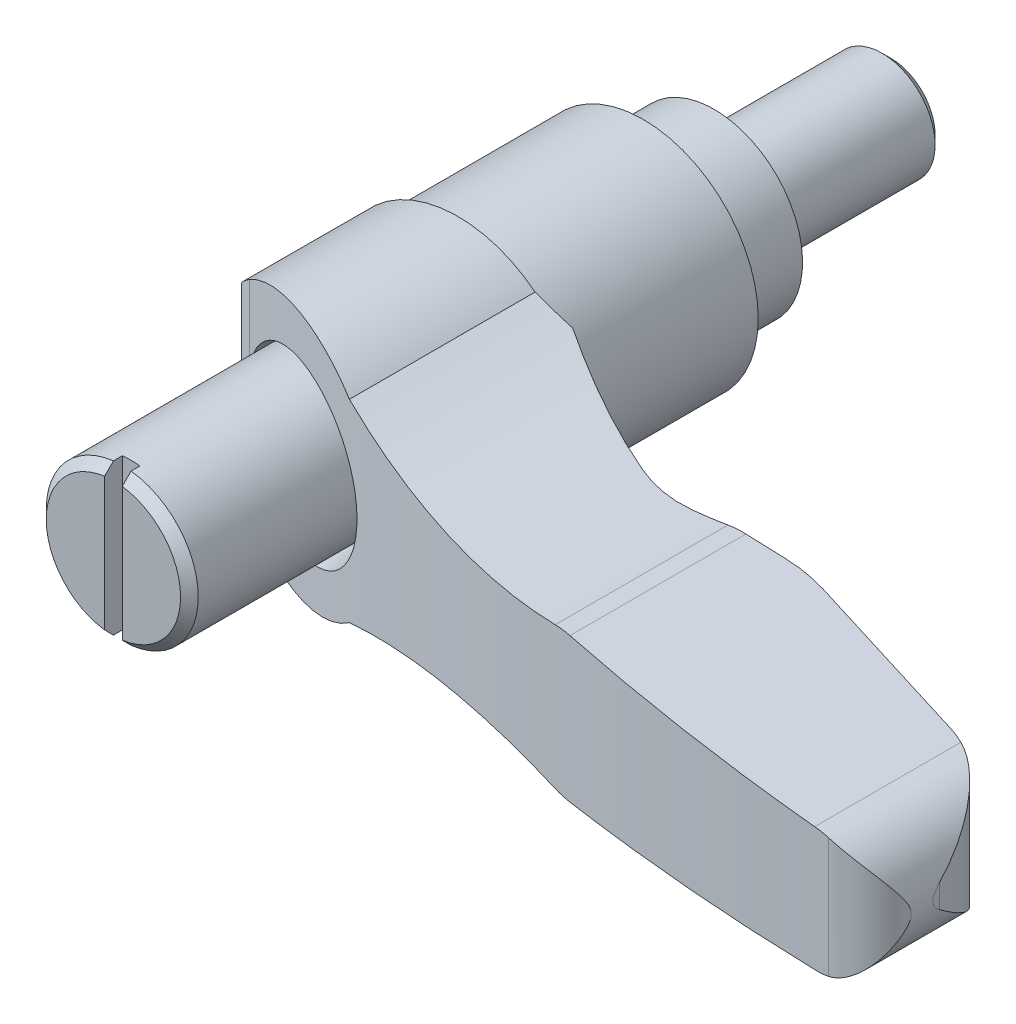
ISO-10303-21;
HEADER;
FILE_DESCRIPTION(('STEP AP214'),'2;1');
FILE_NAME('part.step','',(''),(''),'','','');
FILE_SCHEMA(('AUTOMOTIVE_DESIGN { 1 0 10303 214 1 1 1 1 }'));
ENDSEC;
DATA;
#1=APPLICATION_CONTEXT('core data for automotive mechanical design processes');
#2=APPLICATION_PROTOCOL_DEFINITION('international standard','automotive_design',2000,#1);
#3=PRODUCT_CONTEXT('',#1,'mechanical');
#4=PRODUCT('Part','Part','',(#3));
#5=PRODUCT_RELATED_PRODUCT_CATEGORY('part','',(#4));
#6=PRODUCT_DEFINITION_FORMATION('','',#4);
#7=PRODUCT_DEFINITION_CONTEXT('part definition',#1,'design');
#8=PRODUCT_DEFINITION('design','',#6,#7);
#9=PRODUCT_DEFINITION_SHAPE('','',#8);
#10=(LENGTH_UNIT() NAMED_UNIT(*) SI_UNIT(.MILLI.,.METRE.));
#11=(NAMED_UNIT(*) PLANE_ANGLE_UNIT() SI_UNIT($,.RADIAN.));
#12=(NAMED_UNIT(*) SI_UNIT($,.STERADIAN.) SOLID_ANGLE_UNIT());
#13=UNCERTAINTY_MEASURE_WITH_UNIT(LENGTH_MEASURE(1.E-05),#10,'distance_accuracy_value','');
#14=(GEOMETRIC_REPRESENTATION_CONTEXT(3) GLOBAL_UNCERTAINTY_ASSIGNED_CONTEXT((#13)) GLOBAL_UNIT_ASSIGNED_CONTEXT((#10,
#11,#12)) REPRESENTATION_CONTEXT('',''));
#15=CARTESIAN_POINT('',(0.,0.,0.));
#16=DIRECTION('',(0.,0.,1.));
#17=DIRECTION('',(1.,0.,0.));
#18=AXIS2_PLACEMENT_3D('',#15,#16,#17);
#19=CARTESIAN_POINT('',(0.,0.,-10.));
#20=DIRECTION('',(0.,0.,-1.));
#21=DIRECTION('',(0.,1.,0.));
#22=AXIS2_PLACEMENT_3D('',#19,#20,#21);
#23=PLANE('',#22);
#24=CARTESIAN_POINT('',(0.,0.,-10.));
#25=DIRECTION('',(0.,0.,-1.));
#26=DIRECTION('',(0.,1.,0.));
#27=AXIS2_PLACEMENT_3D('',#24,#25,#26);
#28=CIRCLE('',#27,2.5);
#29=CARTESIAN_POINT('',(0.,2.5,-10.));
#30=VERTEX_POINT('',#29);
#31=EDGE_CURVE('E688',#30,#30,#28,.T.);
#32=ORIENTED_EDGE('',*,*,#31,.T.);
#33=EDGE_LOOP('',(#32));
#34=FACE_BOUND('',#33,.T.);
#35=ADVANCED_FACE('F14',(#34),#23,.T.);
#36=CARTESIAN_POINT('',(0.,0.,-10.));
#37=DIRECTION('',(0.,0.,1.));
#38=DIRECTION('',(0.,-1.,0.));
#39=AXIS2_PLACEMENT_3D('',#36,#37,#38);
#40=CONICAL_SURFACE('',#39,2.5,0.785398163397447);
#41=CARTESIAN_POINT('',(0.,0.,-9.5));
#42=DIRECTION('',(0.,0.,-1.));
#43=DIRECTION('',(0.,1.,0.));
#44=AXIS2_PLACEMENT_3D('',#41,#42,#43);
#45=CIRCLE('',#44,3.);
#46=CARTESIAN_POINT('',(0.,3.,-9.5));
#47=VERTEX_POINT('',#46);
#48=EDGE_CURVE('E18',#47,#47,#45,.F.);
#49=ORIENTED_EDGE('',*,*,#48,.F.);
#50=EDGE_LOOP('',(#49));
#51=FACE_BOUND('',#50,.T.);
#52=ORIENTED_EDGE('',*,*,#31,.F.);
#53=EDGE_LOOP('',(#52));
#54=FACE_BOUND('',#53,.T.);
#55=ADVANCED_FACE('F731',(#51,#54),#40,.T.);
#56=CARTESIAN_POINT('',(0.,0.,-10.));
#57=DIRECTION('',(0.,0.,1.));
#58=DIRECTION('',(0.,-1.,0.));
#59=AXIS2_PLACEMENT_3D('',#56,#57,#58);
#60=CYLINDRICAL_SURFACE('',#59,3.);
#61=ORIENTED_EDGE('',*,*,#48,.T.);
#62=EDGE_LOOP('',(#61));
#63=FACE_BOUND('',#62,.T.);
#64=CARTESIAN_POINT('',(0.,0.,0.));
#65=DIRECTION('',(0.,0.,-1.));
#66=DIRECTION('',(0.,1.,0.));
#67=AXIS2_PLACEMENT_3D('',#64,#65,#66);
#68=CIRCLE('',#67,3.);
#69=CARTESIAN_POINT('',(0.,3.,0.));
#70=VERTEX_POINT('',#69);
#71=EDGE_CURVE('E618',#70,#70,#68,.T.);
#72=ORIENTED_EDGE('',*,*,#71,.T.);
#73=EDGE_LOOP('',(#72));
#74=FACE_BOUND('',#73,.T.);
#75=ADVANCED_FACE('F717',(#63,#74),#60,.T.);
#76=CARTESIAN_POINT('',(5.,0.,0.));
#77=DIRECTION('',(0.,0.,-1.));
#78=DIRECTION('',(0.,1.,0.));
#79=AXIS2_PLACEMENT_3D('',#76,#77,#78);
#80=PLANE('',#79);
#81=CARTESIAN_POINT('',(0.,0.,0.));
#82=DIRECTION('',(0.,0.,1.));
#83=DIRECTION('',(0.,-1.,0.));
#84=AXIS2_PLACEMENT_3D('',#81,#82,#83);
#85=CIRCLE('',#84,5.);
#86=CARTESIAN_POINT('',(0.,-5.,0.));
#87=VERTEX_POINT('',#86);
#88=EDGE_CURVE('E637',#87,#87,#85,.T.);
#89=ORIENTED_EDGE('',*,*,#88,.F.);
#90=EDGE_LOOP('',(#89));
#91=FACE_BOUND('',#90,.T.);
#92=ORIENTED_EDGE('',*,*,#71,.F.);
#93=EDGE_LOOP('',(#92));
#94=FACE_BOUND('',#93,.T.);
#95=ADVANCED_FACE('F715',(#91,#94),#80,.T.);
#96=CARTESIAN_POINT('',(0.,0.,4.));
#97=DIRECTION('',(0.,0.,1.));
#98=DIRECTION('',(0.,-1.,0.));
#99=AXIS2_PLACEMENT_3D('',#96,#97,#98);
#100=CYLINDRICAL_SURFACE('',#99,5.);
#101=ORIENTED_EDGE('',*,*,#88,.T.);
#102=EDGE_LOOP('',(#101));
#103=FACE_BOUND('',#102,.T.);
#104=CARTESIAN_POINT('',(0.,0.,4.55));
#105=DIRECTION('',(0.,0.,1.));
#106=DIRECTION('',(0.,-1.,0.));
#107=AXIS2_PLACEMENT_3D('',#104,#105,#106);
#108=CIRCLE('',#107,5.);
#109=CARTESIAN_POINT('',(0.,-5.,4.55));
#110=VERTEX_POINT('',#109);
#111=EDGE_CURVE('E596',#110,#110,#108,.T.);
#112=ORIENTED_EDGE('',*,*,#111,.F.);
#113=EDGE_LOOP('',(#112));
#114=FACE_BOUND('',#113,.T.);
#115=ADVANCED_FACE('F712',(#103,#114),#100,.T.);
#116=CARTESIAN_POINT('',(0.,0.,34.));
#117=DIRECTION('',(0.,0.,-1.));
#118=DIRECTION('',(0.,1.,0.));
#119=AXIS2_PLACEMENT_3D('',#116,#117,#118);
#120=PLANE('',#119);
#121=CARTESIAN_POINT('',(0.,0.,34.));
#122=DIRECTION('',(0.,0.,-1.));
#123=DIRECTION('',(0.,1.,0.));
#124=AXIS2_PLACEMENT_3D('',#121,#122,#123);
#125=CIRCLE('',#124,3.8);
#126=CARTESIAN_POINT('',(0.5,-3.76696164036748,34.));
#127=VERTEX_POINT('',#126);
#128=CARTESIAN_POINT('',(0.5,3.76696164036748,34.));
#129=VERTEX_POINT('',#128);
#130=EDGE_CURVE('E644',#127,#129,#125,.F.);
#131=ORIENTED_EDGE('',*,*,#130,.T.);
#132=DIRECTION('',(0.,1.,0.));
#133=VECTOR('',#132,1.);
#134=CARTESIAN_POINT('',(0.5,5.,34.));
#135=LINE('',#134,#133);
#136=EDGE_CURVE('E623',#127,#129,#135,.T.);
#137=ORIENTED_EDGE('',*,*,#136,.F.);
#138=EDGE_LOOP('',(#131,#137));
#139=FACE_BOUND('',#138,.T.);
#140=ADVANCED_FACE('F706',(#139),#120,.F.);
#141=CARTESIAN_POINT('',(-0.5,3.76696164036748,34.));
#142=VERTEX_POINT('',#141);
#143=CARTESIAN_POINT('',(-0.5,-3.76696164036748,34.));
#144=VERTEX_POINT('',#143);
#145=EDGE_CURVE('E645',#142,#144,#125,.F.);
#146=ORIENTED_EDGE('',*,*,#145,.T.);
#147=DIRECTION('',(0.,-1.,0.));
#148=VECTOR('',#147,1.);
#149=CARTESIAN_POINT('',(-0.5,5.,34.));
#150=LINE('',#149,#148);
#151=EDGE_CURVE('E621',#142,#144,#150,.T.);
#152=ORIENTED_EDGE('',*,*,#151,.F.);
#153=EDGE_LOOP('',(#146,#152));
#154=FACE_BOUND('',#153,.T.);
#155=ADVANCED_FACE('F704',(#154),#120,.F.);
#156=CARTESIAN_POINT('',(0.,0.,33.5));
#157=DIRECTION('',(0.,0.,-1.));
#158=DIRECTION('',(0.,1.,0.));
#159=AXIS2_PLACEMENT_3D('',#156,#157,#158);
#160=CONICAL_SURFACE('',#159,4.3,0.785398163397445);
#161=CARTESIAN_POINT('',(-0.5,7.14579003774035,30.6367385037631));
#162=CARTESIAN_POINT('',(-0.5,6.87469589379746,30.907163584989));
#163=CARTESIAN_POINT('',(-0.5,6.60357153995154,31.1775584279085));
#164=CARTESIAN_POINT('',(-0.5,6.0612255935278,31.7182262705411));
#165=CARTESIAN_POINT('',(-0.5,5.79000400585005,31.9884992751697));
#166=CARTESIAN_POINT('',(-0.5,5.24743596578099,32.5288529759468));
#167=CARTESIAN_POINT('',(-0.5,4.97608953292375,32.7989336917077));
#168=CARTESIAN_POINT('',(-0.5,4.43313294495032,33.3388536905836));
#169=CARTESIAN_POINT('',(-0.5,4.16152277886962,33.6086929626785));
#170=CARTESIAN_POINT('',(-0.5,3.75373708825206,34.0131478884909));
#171=CARTESIAN_POINT('',(-0.5,3.61772939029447,34.1479327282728));
#172=CARTESIAN_POINT('',(-0.5,3.34555849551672,34.41734068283));
#173=CARTESIAN_POINT('',(-0.5,3.20939530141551,34.5519638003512));
#174=CARTESIAN_POINT('',(-0.5,2.93685991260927,34.8209619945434));
#175=CARTESIAN_POINT('',(-0.5,2.80048774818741,34.9553371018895));
#176=CARTESIAN_POINT('',(-0.5,2.52739320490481,35.2237482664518));
#177=CARTESIAN_POINT('',(-0.5,2.39067080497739,35.3577843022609));
#178=CARTESIAN_POINT('',(-0.5,2.18513448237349,35.5584388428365));
#179=CARTESIAN_POINT('',(-0.5,2.11653083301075,35.6252726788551));
#180=CARTESIAN_POINT('',(-0.5,1.97913719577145,35.7587462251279));
#181=CARTESIAN_POINT('',(-0.5,1.91034721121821,35.8253859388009));
#182=CARTESIAN_POINT('',(-0.5,1.77252789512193,35.9583896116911));
#183=CARTESIAN_POINT('',(-0.5,1.70349861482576,36.0247536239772));
#184=CARTESIAN_POINT('',(-0.5,1.56508132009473,36.1571160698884));
#185=CARTESIAN_POINT('',(-0.5,1.49569328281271,36.223114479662));
#186=CARTESIAN_POINT('',(-0.5,1.35634903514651,36.3546106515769));
#187=CARTESIAN_POINT('',(-0.5,1.28639245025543,36.4201080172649));
#188=CARTESIAN_POINT('',(-0.5,1.14569948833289,36.5502396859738));
#189=CARTESIAN_POINT('',(-0.5,1.07496325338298,36.6148741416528));
#190=CARTESIAN_POINT('',(-0.5,0.967839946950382,36.7107505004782));
#191=CARTESIAN_POINT('',(-0.5,0.931946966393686,36.7425432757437));
#192=CARTESIAN_POINT('',(-0.5,0.859716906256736,36.8056137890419));
#193=CARTESIAN_POINT('',(-0.5,0.823379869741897,36.8368915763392));
#194=CARTESIAN_POINT('',(-0.5,0.750082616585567,36.8987629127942));
#195=CARTESIAN_POINT('',(-0.5,0.713122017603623,36.9293560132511));
#196=CARTESIAN_POINT('',(-0.5,0.638313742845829,36.9894602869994));
#197=CARTESIAN_POINT('',(-0.5,0.600465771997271,37.0189710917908));
#198=CARTESIAN_POINT('',(-0.5,0.562043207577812,37.0477416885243));
#199=B_SPLINE_CURVE_WITH_KNOTS('',3,(#161,#162,#163,#164,#165,#166,#167,#168,#169,#170,#171,
#172,#173,#174,#175,#176,#177,#178,#179,#180,#181,#182,#183,#184,#185,#186,#187,#188,#189,#190,
#191,#192,#193,#194,#195,#196,#197,#198),.UNSPECIFIED.,.F.,.F.,(4,2,2,2,2,2,2,2,2,2,2,2,2,2,2,2,
2,2,4),(0.,1.14873667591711,2.29742189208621,3.44596538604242,4.59455887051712,5.1690023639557,
5.74343596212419,6.31779297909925,6.89218539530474,7.17951595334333,7.46684142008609,
7.75410874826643,8.04139460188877,8.32888815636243,8.61633015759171,8.76017280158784,
8.90400160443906,9.04792205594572,9.19189106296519),.UNSPECIFIED.);
#200=CARTESIAN_POINT('',(-0.5,4.27083130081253,33.5));
#201=VERTEX_POINT('',#200);
#202=EDGE_CURVE('E679',#201,#142,#199,.T.);
#203=ORIENTED_EDGE('',*,*,#202,.F.);
#204=CARTESIAN_POINT('',(0.,0.,33.5));
#205=DIRECTION('',(0.,0.,-1.));
#206=DIRECTION('',(0.,1.,0.));
#207=AXIS2_PLACEMENT_3D('',#204,#205,#206);
#208=CIRCLE('',#207,4.3);
#209=CARTESIAN_POINT('',(-0.5,-4.27083130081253,33.5));
#210=VERTEX_POINT('',#209);
#211=EDGE_CURVE('E640',#210,#201,#208,.T.);
#212=ORIENTED_EDGE('',*,*,#211,.F.);
#213=CARTESIAN_POINT('',(-0.5,-0.562043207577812,37.0477416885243));
#214=CARTESIAN_POINT('',(-0.5,-0.591562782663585,37.0256612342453));
#215=CARTESIAN_POINT('',(-0.5,-0.620732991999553,37.0031254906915));
#216=CARTESIAN_POINT('',(-0.5,-0.678508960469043,36.9573533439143));
#217=CARTESIAN_POINT('',(-0.5,-0.707114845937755,36.9341171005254));
#218=CARTESIAN_POINT('',(-0.5,-0.763893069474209,36.8871574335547));
#219=CARTESIAN_POINT('',(-0.5,-0.792065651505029,36.8634343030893));
#220=CARTESIAN_POINT('',(-0.5,-0.848085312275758,36.8156036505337));
#221=CARTESIAN_POINT('',(-0.5,-0.875932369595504,36.7914961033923));
#222=CARTESIAN_POINT('',(-0.5,-0.959051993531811,36.7187712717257));
#223=CARTESIAN_POINT('',(-0.5,-1.0139429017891,36.669718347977));
#224=CARTESIAN_POINT('',(-0.5,-1.12306845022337,36.5708712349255));
#225=CARTESIAN_POINT('',(-0.5,-1.17730296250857,36.5210769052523));
#226=CARTESIAN_POINT('',(-0.5,-1.34475427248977,36.3659472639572));
#227=CARTESIAN_POINT('',(-0.5,-1.4572060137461,36.2597875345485));
#228=CARTESIAN_POINT('',(-0.5,-1.68111383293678,36.0464226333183));
#229=CARTESIAN_POINT('',(-0.5,-1.79256987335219,35.9392174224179));
#230=CARTESIAN_POINT('',(-0.5,-2.01488759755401,35.7241936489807));
#231=CARTESIAN_POINT('',(-0.5,-2.12574928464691,35.6163750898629));
#232=CARTESIAN_POINT('',(-0.5,-2.34709619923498,35.4003567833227));
#233=CARTESIAN_POINT('',(-0.5,-2.45758143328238,35.2921570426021));
#234=CARTESIAN_POINT('',(-0.5,-2.78891994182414,34.9669349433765));
#235=CARTESIAN_POINT('',(-0.5,-3.00940313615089,34.7495356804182));
#236=CARTESIAN_POINT('',(-0.5,-3.44986918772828,34.3142422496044));
#237=CARTESIAN_POINT('',(-0.5,-3.66985205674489,34.096348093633));
#238=CARTESIAN_POINT('',(-0.5,-4.16175150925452,33.6084656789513));
#239=CARTESIAN_POINT('',(-0.5,-4.43359041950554,33.3383991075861));
#240=CARTESIAN_POINT('',(-0.5,-4.97701825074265,32.798009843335));
#241=CARTESIAN_POINT('',(-0.5,-5.24860716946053,32.5276871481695));
#242=CARTESIAN_POINT('',(-0.5,-5.79118913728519,31.9873183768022));
#243=CARTESIAN_POINT('',(-0.5,-6.06218244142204,31.7172725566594));
#244=CARTESIAN_POINT('',(-0.5,-6.60405724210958,31.1770740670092));
#245=CARTESIAN_POINT('',(-0.5,-6.87493873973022,30.9069213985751));
#246=CARTESIAN_POINT('',(-0.5,-7.14579003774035,30.6367385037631));
#247=B_SPLINE_CURVE_WITH_KNOTS('',3,(#213,#214,#215,#216,#217,#218,#219,#220,#221,#222,#223,
#224,#225,#226,#227,#228,#229,#230,#231,#232,#233,#234,#235,#236,#237,#238,#239,#240,#241,#242,
#243,#244,#245,#246),.UNSPECIFIED.,.F.,.F.,(4,2,2,2,2,2,2,2,2,2,2,2,2,2,2,2,4),(0.,
0.110577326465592,0.221129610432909,0.331617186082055,0.442111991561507,0.662945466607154,
0.883821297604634,1.34774036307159,1.81167683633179,2.27561072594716,2.7395364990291,
3.66844637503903,4.59733417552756,5.74689505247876,6.8964662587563,8.04418527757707,
9.19189304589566),.UNSPECIFIED.);
#248=EDGE_CURVE('E673',#144,#210,#247,.T.);
#249=ORIENTED_EDGE('',*,*,#248,.F.);
#250=ORIENTED_EDGE('',*,*,#145,.F.);
#251=EDGE_LOOP('',(#203,#212,#249,#250));
#252=FACE_BOUND('',#251,.T.);
#253=ADVANCED_FACE('F700',(#252),#160,.T.);
#254=CARTESIAN_POINT('',(0.5,0.562043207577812,37.0477416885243));
#255=CARTESIAN_POINT('',(0.5,0.591562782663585,37.0256612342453));
#256=CARTESIAN_POINT('',(0.5,0.620732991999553,37.0031254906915));
#257=CARTESIAN_POINT('',(0.5,0.678508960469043,36.9573533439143));
#258=CARTESIAN_POINT('',(0.5,0.707114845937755,36.9341171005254));
#259=CARTESIAN_POINT('',(0.5,0.763893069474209,36.8871574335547));
#260=CARTESIAN_POINT('',(0.5,0.792065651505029,36.8634343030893));
#261=CARTESIAN_POINT('',(0.5,0.848085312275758,36.8156036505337));
#262=CARTESIAN_POINT('',(0.5,0.875932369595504,36.7914961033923));
#263=CARTESIAN_POINT('',(0.5,0.959051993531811,36.7187712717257));
#264=CARTESIAN_POINT('',(0.5,1.0139429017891,36.669718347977));
#265=CARTESIAN_POINT('',(0.5,1.12306845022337,36.5708712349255));
#266=CARTESIAN_POINT('',(0.5,1.17730296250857,36.5210769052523));
#267=CARTESIAN_POINT('',(0.5,1.34475427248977,36.3659472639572));
#268=CARTESIAN_POINT('',(0.5,1.4572060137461,36.2597875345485));
#269=CARTESIAN_POINT('',(0.5,1.68111383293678,36.0464226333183));
#270=CARTESIAN_POINT('',(0.5,1.79256987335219,35.9392174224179));
#271=CARTESIAN_POINT('',(0.5,2.01488759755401,35.7241936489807));
#272=CARTESIAN_POINT('',(0.5,2.12574928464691,35.6163750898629));
#273=CARTESIAN_POINT('',(0.5,2.34709619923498,35.4003567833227));
#274=CARTESIAN_POINT('',(0.5,2.45758143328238,35.2921570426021));
#275=CARTESIAN_POINT('',(0.5,2.78891994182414,34.9669349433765));
#276=CARTESIAN_POINT('',(0.5,3.00940313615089,34.7495356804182));
#277=CARTESIAN_POINT('',(0.5,3.44986918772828,34.3142422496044));
#278=CARTESIAN_POINT('',(0.5,3.66985205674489,34.096348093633));
#279=CARTESIAN_POINT('',(0.5,4.16175150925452,33.6084656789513));
#280=CARTESIAN_POINT('',(0.5,4.43359041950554,33.3383991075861));
#281=CARTESIAN_POINT('',(0.5,4.97701825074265,32.798009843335));
#282=CARTESIAN_POINT('',(0.5,5.24860716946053,32.5276871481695));
#283=CARTESIAN_POINT('',(0.5,5.79118913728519,31.9873183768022));
#284=CARTESIAN_POINT('',(0.5,6.06218244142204,31.7172725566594));
#285=CARTESIAN_POINT('',(0.5,6.60405724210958,31.1770740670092));
#286=CARTESIAN_POINT('',(0.5,6.87493873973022,30.9069213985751));
#287=CARTESIAN_POINT('',(0.5,7.14579003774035,30.6367385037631));
#288=B_SPLINE_CURVE_WITH_KNOTS('',3,(#254,#255,#256,#257,#258,#259,#260,#261,#262,#263,#264,
#265,#266,#267,#268,#269,#270,#271,#272,#273,#274,#275,#276,#277,#278,#279,#280,#281,#282,#283,
#284,#285,#286,#287),.UNSPECIFIED.,.F.,.F.,(4,2,2,2,2,2,2,2,2,2,2,2,2,2,2,2,4),(0.,
0.110577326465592,0.221129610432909,0.331617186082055,0.442111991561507,0.662945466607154,
0.883821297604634,1.34774036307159,1.81167683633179,2.27561072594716,2.7395364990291,
3.66844637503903,4.59733417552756,5.74689505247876,6.8964662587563,8.04418527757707,
9.19189304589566),.UNSPECIFIED.);
#289=CARTESIAN_POINT('',(0.5,4.27083130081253,33.5));
#290=VERTEX_POINT('',#289);
#291=EDGE_CURVE('E656',#129,#290,#288,.T.);
#292=ORIENTED_EDGE('',*,*,#291,.F.);
#293=ORIENTED_EDGE('',*,*,#130,.F.);
#294=CARTESIAN_POINT('',(0.5,-7.14579003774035,30.6367385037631));
#295=CARTESIAN_POINT('',(0.5,-6.87469589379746,30.907163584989));
#296=CARTESIAN_POINT('',(0.5,-6.60357153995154,31.1775584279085));
#297=CARTESIAN_POINT('',(0.5,-6.0612255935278,31.7182262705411));
#298=CARTESIAN_POINT('',(0.5,-5.79000400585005,31.9884992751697));
#299=CARTESIAN_POINT('',(0.5,-5.24743596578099,32.5288529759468));
#300=CARTESIAN_POINT('',(0.5,-4.97608953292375,32.7989336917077));
#301=CARTESIAN_POINT('',(0.5,-4.43313294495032,33.3388536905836));
#302=CARTESIAN_POINT('',(0.5,-4.16152277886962,33.6086929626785));
#303=CARTESIAN_POINT('',(0.5,-3.75373708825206,34.0131478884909));
#304=CARTESIAN_POINT('',(0.5,-3.61772939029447,34.1479327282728));
#305=CARTESIAN_POINT('',(0.5,-3.34555849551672,34.41734068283));
#306=CARTESIAN_POINT('',(0.5,-3.20939530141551,34.5519638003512));
#307=CARTESIAN_POINT('',(0.5,-2.93685991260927,34.8209619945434));
#308=CARTESIAN_POINT('',(0.5,-2.80048774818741,34.9553371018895));
#309=CARTESIAN_POINT('',(0.5,-2.52739320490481,35.2237482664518));
#310=CARTESIAN_POINT('',(0.5,-2.39067080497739,35.3577843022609));
#311=CARTESIAN_POINT('',(0.5,-2.18513448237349,35.5584388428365));
#312=CARTESIAN_POINT('',(0.5,-2.11653083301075,35.6252726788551));
#313=CARTESIAN_POINT('',(0.5,-1.97913719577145,35.7587462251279));
#314=CARTESIAN_POINT('',(0.5,-1.91034721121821,35.8253859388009));
#315=CARTESIAN_POINT('',(0.5,-1.77252789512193,35.9583896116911));
#316=CARTESIAN_POINT('',(0.5,-1.70349861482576,36.0247536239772));
#317=CARTESIAN_POINT('',(0.5,-1.56508132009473,36.1571160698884));
#318=CARTESIAN_POINT('',(0.5,-1.49569328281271,36.223114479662));
#319=CARTESIAN_POINT('',(0.5,-1.35634903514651,36.3546106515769));
#320=CARTESIAN_POINT('',(0.5,-1.28639245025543,36.4201080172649));
#321=CARTESIAN_POINT('',(0.5,-1.14569948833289,36.5502396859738));
#322=CARTESIAN_POINT('',(0.5,-1.07496325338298,36.6148741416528));
#323=CARTESIAN_POINT('',(0.5,-0.967839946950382,36.7107505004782));
#324=CARTESIAN_POINT('',(0.5,-0.931946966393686,36.7425432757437));
#325=CARTESIAN_POINT('',(0.5,-0.859716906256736,36.8056137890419));
#326=CARTESIAN_POINT('',(0.5,-0.823379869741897,36.8368915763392));
#327=CARTESIAN_POINT('',(0.5,-0.750082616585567,36.8987629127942));
#328=CARTESIAN_POINT('',(0.5,-0.713122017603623,36.9293560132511));
#329=CARTESIAN_POINT('',(0.5,-0.638313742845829,36.9894602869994));
#330=CARTESIAN_POINT('',(0.5,-0.600465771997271,37.0189710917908));
#331=CARTESIAN_POINT('',(0.5,-0.562043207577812,37.0477416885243));
#332=B_SPLINE_CURVE_WITH_KNOTS('',3,(#294,#295,#296,#297,#298,#299,#300,#301,#302,#303,#304,
#305,#306,#307,#308,#309,#310,#311,#312,#313,#314,#315,#316,#317,#318,#319,#320,#321,#322,#323,
#324,#325,#326,#327,#328,#329,#330,#331),.UNSPECIFIED.,.F.,.F.,(4,2,2,2,2,2,2,2,2,2,2,2,2,2,2,2,
2,2,4),(0.,1.14873667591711,2.29742189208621,3.44596538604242,4.59455887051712,5.1690023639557,
5.74343596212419,6.31779297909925,6.89218539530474,7.17951595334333,7.46684142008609,
7.75410874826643,8.04139460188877,8.32888815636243,8.61633015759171,8.76017280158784,
8.90400160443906,9.04792205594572,9.19189106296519),.UNSPECIFIED.);
#333=CARTESIAN_POINT('',(0.5,-4.27083130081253,33.5));
#334=VERTEX_POINT('',#333);
#335=EDGE_CURVE('E648',#334,#127,#332,.T.);
#336=ORIENTED_EDGE('',*,*,#335,.F.);
#337=EDGE_CURVE('E641',#290,#334,#208,.T.);
#338=ORIENTED_EDGE('',*,*,#337,.F.);
#339=EDGE_LOOP('',(#292,#293,#336,#338));
#340=FACE_BOUND('',#339,.T.);
#341=ADVANCED_FACE('F662',(#340),#160,.T.);
#342=CARTESIAN_POINT('',(0.5,5.,33.));
#343=DIRECTION('',(1.,0.,0.));
#344=DIRECTION('',(0.,1.,0.));
#345=AXIS2_PLACEMENT_3D('',#342,#343,#344);
#346=PLANE('',#345);
#347=DIRECTION('',(0.,0.,1.));
#348=VECTOR('',#347,1.);
#349=CARTESIAN_POINT('',(0.5,4.27083130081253,4.));
#350=LINE('',#349,#348);
#351=CARTESIAN_POINT('',(0.5,4.27083130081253,33.));
#352=VERTEX_POINT('',#351);
#353=EDGE_CURVE('E632',#290,#352,#350,.F.);
#354=ORIENTED_EDGE('',*,*,#353,.T.);
#355=DIRECTION('',(0.,1.,0.));
#356=VECTOR('',#355,1.);
#357=CARTESIAN_POINT('',(0.5,5.,33.));
#358=LINE('',#357,#356);
#359=CARTESIAN_POINT('',(0.5,-4.27083130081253,33.));
#360=VERTEX_POINT('',#359);
#361=EDGE_CURVE('E628',#360,#352,#358,.T.);
#362=ORIENTED_EDGE('',*,*,#361,.F.);
#363=DIRECTION('',(0.,0.,1.));
#364=VECTOR('',#363,1.);
#365=CARTESIAN_POINT('',(0.5,-4.27083130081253,4.));
#366=LINE('',#365,#364);
#367=EDGE_CURVE('E79',#360,#334,#366,.T.);
#368=ORIENTED_EDGE('',*,*,#367,.T.);
#369=ORIENTED_EDGE('',*,*,#335,.T.);
#370=ORIENTED_EDGE('',*,*,#136,.T.);
#371=ORIENTED_EDGE('',*,*,#291,.T.);
#372=EDGE_LOOP('',(#354,#362,#368,#369,#370,#371));
#373=FACE_BOUND('',#372,.T.);
#374=ADVANCED_FACE('F665',(#373),#346,.F.);
#375=CARTESIAN_POINT('',(-0.5,-5.,33.));
#376=DIRECTION('',(0.,0.,1.));
#377=DIRECTION('',(0.,-1.,0.));
#378=AXIS2_PLACEMENT_3D('',#375,#376,#377);
#379=PLANE('',#378);
#380=DIRECTION('',(0.,-1.,0.));
#381=VECTOR('',#380,1.);
#382=CARTESIAN_POINT('',(-0.5,5.,33.));
#383=LINE('',#382,#381);
#384=CARTESIAN_POINT('',(-0.5,4.27083130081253,33.));
#385=VERTEX_POINT('',#384);
#386=CARTESIAN_POINT('',(-0.5,-4.27083130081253,33.));
#387=VERTEX_POINT('',#386);
#388=EDGE_CURVE('E625',#385,#387,#383,.T.);
#389=ORIENTED_EDGE('',*,*,#388,.T.);
#390=CARTESIAN_POINT('',(0.,0.,33.));
#391=DIRECTION('',(0.,0.,1.));
#392=DIRECTION('',(0.,-1.,0.));
#393=AXIS2_PLACEMENT_3D('',#390,#391,#392);
#394=CIRCLE('',#393,4.3);
#395=EDGE_CURVE('E685',#360,#387,#394,.F.);
#396=ORIENTED_EDGE('',*,*,#395,.F.);
#397=ORIENTED_EDGE('',*,*,#361,.T.);
#398=EDGE_CURVE('E687',#385,#352,#394,.F.);
#399=ORIENTED_EDGE('',*,*,#398,.F.);
#400=EDGE_LOOP('',(#389,#396,#397,#399));
#401=FACE_BOUND('',#400,.T.);
#402=ADVANCED_FACE('F587',(#401),#379,.T.);
#403=CARTESIAN_POINT('',(-0.5,5.,33.));
#404=DIRECTION('',(-1.,0.,0.));
#405=DIRECTION('',(0.,-1.,0.));
#406=AXIS2_PLACEMENT_3D('',#403,#404,#405);
#407=PLANE('',#406);
#408=DIRECTION('',(0.,0.,1.));
#409=VECTOR('',#408,1.);
#410=CARTESIAN_POINT('',(-0.5,4.27083130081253,4.));
#411=LINE('',#410,#409);
#412=EDGE_CURVE('E72',#385,#201,#411,.T.);
#413=ORIENTED_EDGE('',*,*,#412,.T.);
#414=ORIENTED_EDGE('',*,*,#202,.T.);
#415=ORIENTED_EDGE('',*,*,#151,.T.);
#416=ORIENTED_EDGE('',*,*,#248,.T.);
#417=DIRECTION('',(0.,0.,1.));
#418=VECTOR('',#417,1.);
#419=CARTESIAN_POINT('',(-0.5,-4.27083130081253,4.));
#420=LINE('',#419,#418);
#421=EDGE_CURVE('E634',#210,#387,#420,.F.);
#422=ORIENTED_EDGE('',*,*,#421,.T.);
#423=ORIENTED_EDGE('',*,*,#388,.F.);
#424=EDGE_LOOP('',(#413,#414,#415,#416,#422,#423));
#425=FACE_BOUND('',#424,.T.);
#426=ADVANCED_FACE('F581',(#425),#407,.F.);
#427=CARTESIAN_POINT('',(0.,0.,4.));
#428=DIRECTION('',(0.,0.,1.));
#429=DIRECTION('',(0.,-1.,0.));
#430=AXIS2_PLACEMENT_3D('',#427,#428,#429);
#431=CYLINDRICAL_SURFACE('',#430,4.3);
#432=ORIENTED_EDGE('',*,*,#412,.F.);
#433=ORIENTED_EDGE('',*,*,#398,.T.);
#434=ORIENTED_EDGE('',*,*,#353,.F.);
#435=ORIENTED_EDGE('',*,*,#337,.T.);
#436=ORIENTED_EDGE('',*,*,#367,.F.);
#437=ORIENTED_EDGE('',*,*,#395,.T.);
#438=ORIENTED_EDGE('',*,*,#421,.F.);
#439=ORIENTED_EDGE('',*,*,#211,.T.);
#440=EDGE_LOOP('',(#432,#433,#434,#435,#436,#437,#438,#439));
#441=FACE_BOUND('',#440,.T.);
#442=CARTESIAN_POINT('',(0.,0.,21.34));
#443=DIRECTION('',(0.,0.,1.));
#444=DIRECTION('',(0.,-1.,0.));
#445=AXIS2_PLACEMENT_3D('',#442,#443,#444);
#446=CIRCLE('',#445,4.3);
#447=CARTESIAN_POINT('',(0.,-4.3,21.34));
#448=VERTEX_POINT('',#447);
#449=EDGE_CURVE('E594',#448,#448,#446,.T.);
#450=ORIENTED_EDGE('',*,*,#449,.T.);
#451=EDGE_LOOP('',(#450));
#452=FACE_BOUND('',#451,.T.);
#453=ADVANCED_FACE('F16',(#441,#452),#431,.T.);
#454=CARTESIAN_POINT('',(39.938965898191,-8.,27.204249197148));
#455=DIRECTION('',(-0.989626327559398,0.,0.143665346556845));
#456=DIRECTION('',(-0.143665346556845,0.,-0.989626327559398));
#457=AXIS2_PLACEMENT_3D('',#454,#455,#456);
#458=PLANE('',#457);
#459=CARTESIAN_POINT('',(36.5,0.,3.51522972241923));
#460=DIRECTION('',(-0.989626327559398,0.,0.143665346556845));
#461=DIRECTION('',(0.143665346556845,0.,0.989626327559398));
#462=AXIS2_PLACEMENT_3D('',#459,#460,#461);
#463=ELLIPSE('',#462,24.3621728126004,3.5);
#464=CARTESIAN_POINT('',(39.938965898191,-0.650779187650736,27.204249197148));
#465=VERTEX_POINT('',#464);
#466=CARTESIAN_POINT('',(39.938965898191,0.650779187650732,27.204249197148));
#467=VERTEX_POINT('',#466);
#468=EDGE_CURVE('E404',#465,#467,#463,.T.);
#469=ORIENTED_EDGE('',*,*,#468,.F.);
#470=DIRECTION('',(0.,1.,0.));
#471=VECTOR('',#470,1.);
#472=CARTESIAN_POINT('',(39.938965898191,-8.,27.204249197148));
#473=LINE('',#472,#471);
#474=EDGE_CURVE('E249',#465,#467,#473,.T.);
#475=ORIENTED_EDGE('',*,*,#474,.T.);
#476=EDGE_LOOP('',(#469,#475));
#477=FACE_BOUND('',#476,.T.);
#478=ADVANCED_FACE('F415',(#477),#458,.F.);
#479=CARTESIAN_POINT('',(33.8626602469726,-8.,28.0863544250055));
#480=DIRECTION('',(0.,1.,0.));
#481=DIRECTION('',(-1.,0.,0.));
#482=AXIS2_PLACEMENT_3D('',#479,#480,#481);
#483=CYLINDRICAL_SURFACE('',#482,6.14000000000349);
#484=CARTESIAN_POINT('',(33.8626602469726,3.59762871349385,28.0863544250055));
#485=DIRECTION('',(0.0369925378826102,0.999315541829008,0.));
#486=DIRECTION('',(-0.999315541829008,0.0369925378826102,0.));
#487=AXIS2_PLACEMENT_3D('',#484,#485,#486);
#488=ELLIPSE('',#487,6.14420545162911,6.14000000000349);
#489=CARTESIAN_POINT('',(36.5,3.5,22.5416236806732));
#490=VERTEX_POINT('',#489);
#491=CARTESIAN_POINT('',(35.534460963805,3.53574220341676,22.178335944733));
#492=VERTEX_POINT('',#491);
#493=EDGE_CURVE('E574',#490,#492,#488,.T.);
#494=ORIENTED_EDGE('',*,*,#493,.F.);
#495=CARTESIAN_POINT('',(39.938965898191,0.650779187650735,27.204249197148));
#496=CARTESIAN_POINT('',(39.9247028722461,0.726086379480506,27.1059853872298));
#497=CARTESIAN_POINT('',(39.9079968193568,0.800887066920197,27.007686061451));
#498=CARTESIAN_POINT('',(39.8696347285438,0.949458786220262,26.8112602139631));
#499=CARTESIAN_POINT('',(39.8479781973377,1.02322971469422,26.7131337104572));
#500=CARTESIAN_POINT('',(39.7995979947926,1.16988012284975,26.5170899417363));
#501=CARTESIAN_POINT('',(39.7728626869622,1.24275713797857,26.4191736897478));
#502=CARTESIAN_POINT('',(39.7142815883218,1.38725410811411,26.2239599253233));
#503=CARTESIAN_POINT('',(39.6824358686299,1.45887408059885,26.1266624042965));
#504=CARTESIAN_POINT('',(39.5782917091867,1.67318502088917,25.8337016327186));
#505=CARTESIAN_POINT('',(39.4979263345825,1.81366367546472,25.6391889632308));
#506=CARTESIAN_POINT('',(39.3150854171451,2.08619457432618,25.2551202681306));
#507=CARTESIAN_POINT('',(39.2126344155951,2.21825596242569,25.0655590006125));
#508=CARTESIAN_POINT('',(38.9595027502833,2.49877334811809,24.6523338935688));
#509=CARTESIAN_POINT('',(38.8031801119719,2.64456339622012,24.4302018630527));
#510=CARTESIAN_POINT('',(38.5417124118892,2.84488994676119,24.108275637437));
#511=CARTESIAN_POINT('',(38.4501831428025,2.90854134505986,24.0029632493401));
#512=CARTESIAN_POINT('',(38.2579442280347,3.02861213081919,23.7967186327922));
#513=CARTESIAN_POINT('',(38.1572360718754,3.08503268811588,23.6957856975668));
#514=CARTESIAN_POINT('',(37.8892625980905,3.21757634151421,23.4457323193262));
#515=CARTESIAN_POINT('',(37.7155213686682,3.28779061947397,23.3001643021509));
#516=CARTESIAN_POINT('',(37.4396992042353,3.37286339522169,23.0946053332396));
#517=CARTESIAN_POINT('',(37.3453175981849,3.39783246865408,23.0282732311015));
#518=CARTESIAN_POINT('',(37.1517842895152,3.44019984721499,22.9003457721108));
#519=CARTESIAN_POINT('',(37.0526354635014,3.45760265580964,22.8387476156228));
#520=CARTESIAN_POINT('',(36.8781783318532,3.48029211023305,22.7372021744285));
#521=CARTESIAN_POINT('',(36.8038676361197,3.48759914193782,22.6959814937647));
#522=CARTESIAN_POINT('',(36.6533047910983,3.49745586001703,22.6165121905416));
#523=CARTESIAN_POINT('',(36.5770513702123,3.50000234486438,22.57826558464));
#524=CARTESIAN_POINT('',(36.5,3.5,22.5416236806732));
#525=B_SPLINE_CURVE_WITH_KNOTS('',3,(#495,#496,#497,#498,#499,#500,#501,#502,#503,#504,#505,
#506,#507,#508,#509,#510,#511,#512,#513,#514,#515,#516,#517,#518,#519,#520,#521,#522,#523,#524),
.UNSPECIFIED.,.F.,.F.,(4,2,2,2,2,2,2,2,2,2,2,2,2,2,4),(0.,0.373839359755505,0.747715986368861,
1.1224598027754,1.49719840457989,2.25512351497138,3.01221072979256,3.93367725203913,
4.39332639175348,4.85290107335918,5.56171222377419,5.91546495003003,6.26900683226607,
6.52468766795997,6.78054039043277),.UNSPECIFIED.);
#526=EDGE_CURVE('E403',#467,#490,#525,.T.);
#527=ORIENTED_EDGE('',*,*,#526,.F.);
#528=ORIENTED_EDGE('',*,*,#474,.F.);
#529=CARTESIAN_POINT('',(36.5,-3.5,22.5416236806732));
#530=CARTESIAN_POINT('',(36.6061539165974,-3.50000941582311,22.5920863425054));
#531=CARTESIAN_POINT('',(36.7107657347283,-3.49517280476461,22.6456099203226));
#532=CARTESIAN_POINT('',(36.9160027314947,-3.47671082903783,22.7581011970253));
#533=CARTESIAN_POINT('',(37.016634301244,-3.46310021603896,22.8170596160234));
#534=CARTESIAN_POINT('',(37.212347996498,-3.42816986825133,22.9392782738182));
#535=CARTESIAN_POINT('',(37.3074768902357,-3.40693163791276,23.0024874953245));
#536=CARTESIAN_POINT('',(37.4929223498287,-3.35757592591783,23.1332068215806));
#537=CARTESIAN_POINT('',(37.5832363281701,-3.32945478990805,23.2007191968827));
#538=CARTESIAN_POINT('',(37.7830795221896,-3.2585052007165,23.3587409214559));
#539=CARTESIAN_POINT('',(37.8909927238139,-3.21376078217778,23.4504360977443));
#540=CARTESIAN_POINT('',(38.0982482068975,-3.11588681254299,23.6389903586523));
#541=CARTESIAN_POINT('',(38.1975840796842,-3.06275107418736,23.7358532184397));
#542=CARTESIAN_POINT('',(38.3880468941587,-2.94917464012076,23.934309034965));
#543=CARTESIAN_POINT('',(38.4791322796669,-2.88870020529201,24.035922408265));
#544=CARTESIAN_POINT('',(38.6526412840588,-2.761826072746,24.2426721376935));
#545=CARTESIAN_POINT('',(38.7350674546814,-2.69542813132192,24.3478074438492));
#546=CARTESIAN_POINT('',(38.9229341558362,-2.52996933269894,24.6038856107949));
#547=CARTESIAN_POINT('',(39.0243159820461,-2.42850340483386,24.7562617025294));
#548=CARTESIAN_POINT('',(39.2111706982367,-2.21796613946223,25.0654781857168));
#549=CARTESIAN_POINT('',(39.2966363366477,-2.10889136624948,25.2223205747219));
#550=CARTESIAN_POINT('',(39.4522229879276,-1.88493092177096,25.5392893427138));
#551=CARTESIAN_POINT('',(39.5223498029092,-1.77004746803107,25.6994144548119));
#552=CARTESIAN_POINT('',(39.6478320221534,-1.53583460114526,26.0220530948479));
#553=CARTESIAN_POINT('',(39.7031929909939,-1.41650688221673,26.1845656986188));
#554=CARTESIAN_POINT('',(39.7933776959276,-1.19018579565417,26.4900634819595));
#555=CARTESIAN_POINT('',(39.8299343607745,-1.08360162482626,26.6328455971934));
#556=CARTESIAN_POINT('',(39.8923391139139,-0.86858691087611,26.9185049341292));
#557=CARTESIAN_POINT('',(39.9182264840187,-0.760164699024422,27.0613798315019));
#558=CARTESIAN_POINT('',(39.938965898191,-0.650779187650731,27.204249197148));
#559=B_SPLINE_CURVE_WITH_KNOTS('',3,(#529,#530,#531,#532,#533,#534,#535,#536,#537,#538,#539,
#540,#541,#542,#543,#544,#545,#546,#547,#548,#549,#550,#551,#552,#553,#554,#555,#556,#557,#558),
.UNSPECIFIED.,.F.,.F.,(4,2,2,2,2,2,2,2,2,2,2,2,2,2,4),(0.,0.352350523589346,0.704110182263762,
1.05221781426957,1.40051067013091,1.84538152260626,2.29058194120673,2.73791274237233,
3.18511134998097,3.81198117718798,4.43913591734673,5.06605301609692,5.69273352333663,
6.23807905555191,6.78139842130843),.UNSPECIFIED.);
#560=CARTESIAN_POINT('',(36.5,-3.5,22.5416236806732));
#561=VERTEX_POINT('',#560);
#562=EDGE_CURVE('E397',#561,#465,#559,.T.);
#563=ORIENTED_EDGE('',*,*,#562,.F.);
#564=CARTESIAN_POINT('',(33.8626602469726,-3.59762871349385,28.0863544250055));
#565=DIRECTION('',(0.0369925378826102,-0.999315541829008,0.));
#566=DIRECTION('',(0.999315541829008,0.0369925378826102,0.));
#567=AXIS2_PLACEMENT_3D('',#564,#565,#566);
#568=ELLIPSE('',#567,6.14420545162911,6.14000000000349);
#569=CARTESIAN_POINT('',(35.534460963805,-3.53574220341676,22.178335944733));
#570=VERTEX_POINT('',#569);
#571=EDGE_CURVE('E559',#570,#561,#568,.T.);
#572=ORIENTED_EDGE('',*,*,#571,.F.);
#573=DIRECTION('',(0.,1.,0.));
#574=VECTOR('',#573,1.);
#575=CARTESIAN_POINT('',(35.534460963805,-8.,22.178335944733));
#576=LINE('',#575,#574);
#577=EDGE_CURVE('E252',#570,#492,#576,.T.);
#578=ORIENTED_EDGE('',*,*,#577,.T.);
#579=EDGE_LOOP('',(#494,#527,#528,#563,#572,#578));
#580=FACE_BOUND('',#579,.T.);
#581=ADVANCED_FACE('F410',(#580),#483,.T.);
#582=CARTESIAN_POINT('',(25.51080482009,-8.,19.34192715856));
#583=DIRECTION('',(-0.272280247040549,0.,0.962217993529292));
#584=DIRECTION('',(-0.962217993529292,0.,-0.272280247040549));
#585=AXIS2_PLACEMENT_3D('',#582,#583,#584);
#586=PLANE('',#585);
#587=DIRECTION('',(-0.961608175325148,0.0355966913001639,-0.272107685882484));
#588=VECTOR('',#587,1.);
#589=CARTESIAN_POINT('',(25.918375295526,3.8917092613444,19.457257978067));
#590=LINE('',#589,#588);
#591=CARTESIAN_POINT('',(25.51080482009,3.90679665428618,19.34192715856));
#592=VERTEX_POINT('',#591);
#593=EDGE_CURVE('E1192',#492,#592,#590,.T.);
#594=ORIENTED_EDGE('',*,*,#593,.F.);
#595=ORIENTED_EDGE('',*,*,#577,.F.);
#596=DIRECTION('',(0.961608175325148,0.0355966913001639,0.272107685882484));
#597=VECTOR('',#596,1.);
#598=CARTESIAN_POINT('',(25.3706941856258,-3.9119832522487,19.3022798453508));
#599=LINE('',#598,#597);
#600=CARTESIAN_POINT('',(25.51080482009,-3.90679665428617,19.34192715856));
#601=VERTEX_POINT('',#600);
#602=EDGE_CURVE('E561',#601,#570,#599,.T.);
#603=ORIENTED_EDGE('',*,*,#602,.F.);
#604=DIRECTION('',(0.,1.,0.));
#605=VECTOR('',#604,1.);
#606=CARTESIAN_POINT('',(25.51080482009,-8.,19.34192715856));
#607=LINE('',#606,#605);
#608=EDGE_CURVE('E255',#601,#592,#607,.T.);
#609=ORIENTED_EDGE('',*,*,#608,.T.);
#610=EDGE_LOOP('',(#594,#595,#603,#609));
#611=FACE_BOUND('',#610,.T.);
#612=ADVANCED_FACE('F414',(#611),#586,.F.);
#613=CARTESIAN_POINT('',(23.0466685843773,-8.,28.0499999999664));
#614=DIRECTION('',(0.,1.,0.));
#615=DIRECTION('',(-1.,0.,0.));
#616=AXIS2_PLACEMENT_3D('',#613,#614,#615);
#617=CYLINDRICAL_SURFACE('',#616,9.04999999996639);
#618=CARTESIAN_POINT('',(23.0466685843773,3.99801374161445,28.0499999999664));
#619=DIRECTION('',(0.0369925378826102,0.999315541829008,0.));
#620=DIRECTION('',(-0.999315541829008,0.0369925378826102,0.));
#621=AXIS2_PLACEMENT_3D('',#618,#619,#620);
#622=ELLIPSE('',#621,9.05619858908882,9.04999999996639);
#623=CARTESIAN_POINT('',(23.046668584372,3.99801374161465,19.));
#624=VERTEX_POINT('',#623);
#625=EDGE_CURVE('E1187',#592,#624,#622,.T.);
#626=ORIENTED_EDGE('',*,*,#625,.F.);
#627=ORIENTED_EDGE('',*,*,#608,.F.);
#628=CARTESIAN_POINT('',(23.0466685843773,-3.99801374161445,28.0499999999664));
#629=DIRECTION('',(0.0369925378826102,-0.999315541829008,0.));
#630=DIRECTION('',(0.999315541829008,0.0369925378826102,0.));
#631=AXIS2_PLACEMENT_3D('',#628,#629,#630);
#632=ELLIPSE('',#631,9.05619858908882,9.04999999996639);
#633=CARTESIAN_POINT('',(23.046668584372,-3.99801374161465,19.));
#634=VERTEX_POINT('',#633);
#635=EDGE_CURVE('E563',#634,#601,#632,.T.);
#636=ORIENTED_EDGE('',*,*,#635,.F.);
#637=DIRECTION('',(0.,1.,0.));
#638=VECTOR('',#637,1.);
#639=CARTESIAN_POINT('',(23.046668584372,-8.,19.));
#640=LINE('',#639,#638);
#641=EDGE_CURVE('E258',#634,#624,#640,.T.);
#642=ORIENTED_EDGE('',*,*,#641,.T.);
#643=EDGE_LOOP('',(#626,#627,#636,#642));
#644=FACE_BOUND('',#643,.T.);
#645=ADVANCED_FACE('F420',(#644),#617,.T.);
#646=CARTESIAN_POINT('',(17.750423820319,-8.,19.));
#647=DIRECTION('',(0.,0.,1.));
#648=DIRECTION('',(0.,-1.,0.));
#649=AXIS2_PLACEMENT_3D('',#646,#647,#648);
#650=PLANE('',#649);
#651=CARTESIAN_POINT('',(14.8,33.6,19.));
#652=DIRECTION('',(0.,0.,1.));
#653=DIRECTION('',(0.,-1.,0.));
#654=AXIS2_PLACEMENT_3D('',#651,#652,#653);
#655=CIRCLE('',#654,30.);
#656=CARTESIAN_POINT('',(19.776621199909,4.0156588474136,19.));
#657=VERTEX_POINT('',#656);
#658=CARTESIAN_POINT('',(17.750423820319,3.74543587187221,19.));
#659=VERTEX_POINT('',#658);
#660=EDGE_CURVE('E455',#657,#659,#655,.F.);
#661=ORIENTED_EDGE('',*,*,#660,.F.);
#662=CARTESIAN_POINT('',(20.6060580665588,-0.915064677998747,19.));
#663=DIRECTION('',(0.,0.,1.));
#664=DIRECTION('',(0.,-1.,0.));
#665=AXIS2_PLACEMENT_3D('',#662,#663,#664);
#666=CIRCLE('',#665,4.99999999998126);
#667=CARTESIAN_POINT('',(20.791020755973,4.0815130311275,19.));
#668=VERTEX_POINT('',#667);
#669=EDGE_CURVE('E1179',#668,#657,#666,.T.);
#670=ORIENTED_EDGE('',*,*,#669,.F.);
#671=DIRECTION('',(-0.999315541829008,0.0369925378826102,0.));
#672=VECTOR('',#671,1.);
#673=CARTESIAN_POINT('',(18.2012046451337,4.17738252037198,19.));
#674=LINE('',#673,#672);
#675=EDGE_CURVE('E527',#624,#668,#674,.T.);
#676=ORIENTED_EDGE('',*,*,#675,.F.);
#677=ORIENTED_EDGE('',*,*,#641,.F.);
#678=DIRECTION('',(0.999315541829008,0.0369925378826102,0.));
#679=VECTOR('',#678,1.);
#680=CARTESIAN_POINT('',(17.6097291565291,-4.19927768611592,19.));
#681=LINE('',#680,#679);
#682=CARTESIAN_POINT('',(20.791020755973,-4.0815130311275,19.));
#683=VERTEX_POINT('',#682);
#684=EDGE_CURVE('E564',#683,#634,#681,.T.);
#685=ORIENTED_EDGE('',*,*,#684,.F.);
#686=CARTESIAN_POINT('',(20.6060580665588,0.915064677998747,19.));
#687=DIRECTION('',(0.,0.,1.));
#688=DIRECTION('',(0.,-1.,0.));
#689=AXIS2_PLACEMENT_3D('',#686,#687,#688);
#690=CIRCLE('',#689,4.99999999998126);
#691=CARTESIAN_POINT('',(19.776621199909,-4.01565884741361,19.));
#692=VERTEX_POINT('',#691);
#693=EDGE_CURVE('E551',#692,#683,#690,.T.);
#694=ORIENTED_EDGE('',*,*,#693,.F.);
#695=CARTESIAN_POINT('',(14.8,-33.6,19.));
#696=DIRECTION('',(0.,0.,1.));
#697=DIRECTION('',(0.,-1.,0.));
#698=AXIS2_PLACEMENT_3D('',#695,#696,#697);
#699=CIRCLE('',#698,30.);
#700=CARTESIAN_POINT('',(17.750423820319,-3.74543587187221,19.));
#701=VERTEX_POINT('',#700);
#702=EDGE_CURVE('E546',#701,#692,#699,.F.);
#703=ORIENTED_EDGE('',*,*,#702,.F.);
#704=DIRECTION('',(0.,1.,0.));
#705=VECTOR('',#704,1.);
#706=CARTESIAN_POINT('',(17.750423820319,-8.,19.));
#707=LINE('',#706,#705);
#708=EDGE_CURVE('E261',#701,#659,#707,.T.);
#709=ORIENTED_EDGE('',*,*,#708,.T.);
#710=EDGE_LOOP('',(#661,#670,#676,#677,#685,#694,#703,#709));
#711=FACE_BOUND('',#710,.T.);
#712=ADVANCED_FACE('F424',(#711),#650,.F.);
#713=CARTESIAN_POINT('',(17.7504238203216,-8.,9.94999999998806));
#714=DIRECTION('',(0.,1.,0.));
#715=DIRECTION('',(-1.,0.,0.));
#716=AXIS2_PLACEMENT_3D('',#713,#714,#715);
#717=CYLINDRICAL_SURFACE('',#716,9.05000000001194);
#718=CARTESIAN_POINT('',(17.750423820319,3.74543587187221,19.));
#719=CARTESIAN_POINT('',(17.5046390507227,3.72111558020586,19.0000347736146));
#720=CARTESIAN_POINT('',(17.2585407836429,3.69988852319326,18.9899888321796));
#721=CARTESIAN_POINT('',(16.7673975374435,3.66357523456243,18.9498183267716));
#722=CARTESIAN_POINT('',(16.5223532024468,3.6484923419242,18.9196828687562));
#723=CARTESIAN_POINT('',(16.0394135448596,3.62465265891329,18.8400993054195));
#724=CARTESIAN_POINT('',(15.8014675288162,3.61579257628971,18.7909886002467));
#725=CARTESIAN_POINT('',(15.3302904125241,3.60376296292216,18.673778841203));
#726=CARTESIAN_POINT('',(15.0970562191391,3.60058957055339,18.6056927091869));
#727=CARTESIAN_POINT('',(14.7640124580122,3.59984438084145,18.4937500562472));
#728=CARTESIAN_POINT('',(14.6616681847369,3.60014663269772,18.4572847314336));
#729=CARTESIAN_POINT('',(14.4579719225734,3.60177627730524,18.3805483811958));
#730=CARTESIAN_POINT('',(14.3566253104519,3.60310763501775,18.340263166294));
#731=CARTESIAN_POINT('',(14.2560355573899,3.60493202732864,18.2981585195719));
#732=B_SPLINE_CURVE_WITH_KNOTS('',3,(#718,#719,#720,#721,#722,#723,#724,#725,#726,#727,#728,
#729,#730,#731),.UNSPECIFIED.,.F.,.F.,(4,2,2,2,2,2,4),(0.,0.7407456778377,1.48189337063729,
2.21042785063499,2.93846742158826,3.26434594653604,3.59148632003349),.UNSPECIFIED.);
#733=CARTESIAN_POINT('',(14.2560355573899,3.60493202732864,18.2981585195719));
#734=VERTEX_POINT('',#733);
#735=EDGE_CURVE('E447',#659,#734,#732,.T.);
#736=ORIENTED_EDGE('',*,*,#735,.F.);
#737=ORIENTED_EDGE('',*,*,#708,.F.);
#738=CARTESIAN_POINT('',(14.2560355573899,-3.60493202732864,18.2981585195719));
#739=CARTESIAN_POINT('',(14.483816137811,-3.60077563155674,18.3935396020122));
#740=CARTESIAN_POINT('',(14.7155749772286,-3.59919241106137,18.4795580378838));
#741=CARTESIAN_POINT('',(15.1854578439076,-3.60156277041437,18.6324166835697));
#742=CARTESIAN_POINT('',(15.423585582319,-3.60551965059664,18.6992454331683));
#743=CARTESIAN_POINT('',(15.9002362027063,-3.61924836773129,18.8121846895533));
#744=CARTESIAN_POINT('',(16.1386829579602,-3.62891979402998,18.8586293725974));
#745=CARTESIAN_POINT('',(16.6180975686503,-3.65418161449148,18.9321530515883));
#746=CARTESIAN_POINT('',(16.85906355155,-3.6697678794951,18.9592455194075));
#747=CARTESIAN_POINT('',(17.2084780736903,-3.69663888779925,18.9844088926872));
#748=CARTESIAN_POINT('',(17.316603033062,-3.70554405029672,18.9902441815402));
#749=CARTESIAN_POINT('',(17.5333084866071,-3.72457700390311,18.9980471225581));
#750=CARTESIAN_POINT('',(17.6418891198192,-3.73470940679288,18.9999996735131));
#751=CARTESIAN_POINT('',(17.750423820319,-3.74543587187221,19.));
#752=B_SPLINE_CURVE_WITH_KNOTS('',3,(#738,#739,#740,#741,#742,#743,#744,#745,#746,#747,#748,
#749,#750,#751),.UNSPECIFIED.,.F.,.F.,(4,2,2,2,2,2,4),(0.,0.740736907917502,1.48191527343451,
2.21044217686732,2.93846142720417,3.26434207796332,3.59148772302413),.UNSPECIFIED.);
#753=CARTESIAN_POINT('',(14.2560355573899,-3.60493202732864,18.2981585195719));
#754=VERTEX_POINT('',#753);
#755=EDGE_CURVE('E439',#754,#701,#752,.T.);
#756=ORIENTED_EDGE('',*,*,#755,.F.);
#757=DIRECTION('',(0.,1.,0.));
#758=VECTOR('',#757,1.);
#759=CARTESIAN_POINT('',(14.2560355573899,-8.,18.2981585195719));
#760=LINE('',#759,#758);
#761=EDGE_CURVE('E264',#754,#734,#760,.T.);
#762=ORIENTED_EDGE('',*,*,#761,.T.);
#763=EDGE_LOOP('',(#736,#737,#756,#762));
#764=FACE_BOUND('',#763,.T.);
#765=ADVANCED_FACE('F428',(#764),#717,.F.);
#766=CARTESIAN_POINT('',(42.8289340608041,-8.,-49.9630271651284));
#767=DIRECTION('',(0.,1.,0.));
#768=DIRECTION('',(-1.,0.,0.));
#769=AXIS2_PLACEMENT_3D('',#766,#767,#768);
#770=CYLINDRICAL_SURFACE('',#769,73.9999999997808);
#771=ORIENTED_EDGE('',*,*,#761,.F.);
#772=CARTESIAN_POINT('',(6.49,-4.77390244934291,14.5));
#773=CARTESIAN_POINT('',(7.10709183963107,-4.59600017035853,14.8479114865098));
#774=CARTESIAN_POINT('',(7.73340291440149,-4.43691869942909,15.1892512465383));
#775=CARTESIAN_POINT('',(8.9999083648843,-4.15891482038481,15.8557045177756));
#776=CARTESIAN_POINT('',(9.64003521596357,-4.03983028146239,16.1808788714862));
#777=CARTESIAN_POINT('',(10.9347595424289,-3.84283944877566,16.814824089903));
#778=CARTESIAN_POINT('',(11.5893580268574,-3.76493603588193,17.1235938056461));
#779=CARTESIAN_POINT('',(12.5814258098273,-3.68029491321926,17.5737847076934));
#780=CARTESIAN_POINT('',(12.9145226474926,-3.65743626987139,17.7219861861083));
#781=CARTESIAN_POINT('',(13.583370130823,-3.62280963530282,18.0136612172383));
#782=CARTESIAN_POINT('',(13.9191209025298,-3.6110421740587,18.1571345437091));
#783=CARTESIAN_POINT('',(14.2560355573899,-3.60493202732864,18.298158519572));
#784=B_SPLINE_CURVE_WITH_KNOTS('',3,(#772,#773,#774,#775,#776,#777,#778,#779,#780,#781,#782,
#783),.UNSPECIFIED.,.F.,.F.,(4,2,2,2,2,4),(0.,2.19098662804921,4.37298159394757,
6.55512918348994,7.6508296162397,8.74658240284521),.UNSPECIFIED.);
#785=CARTESIAN_POINT('',(6.49,-4.77390244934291,14.5));
#786=VERTEX_POINT('',#785);
#787=EDGE_CURVE('E485',#786,#754,#784,.T.);
#788=ORIENTED_EDGE('',*,*,#787,.F.);
#789=DIRECTION('',(0.,1.,0.));
#790=VECTOR('',#789,1.);
#791=CARTESIAN_POINT('',(6.49,-8.,14.5));
#792=LINE('',#791,#790);
#793=CARTESIAN_POINT('',(6.49,0.,14.5));
#794=VERTEX_POINT('',#793);
#795=EDGE_CURVE('E268',#786,#794,#792,.T.);
#796=ORIENTED_EDGE('',*,*,#795,.T.);
#797=CARTESIAN_POINT('',(6.49,4.77390244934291,14.5));
#798=VERTEX_POINT('',#797);
#799=EDGE_CURVE('E267',#794,#798,#792,.T.);
#800=ORIENTED_EDGE('',*,*,#799,.T.);
#801=CARTESIAN_POINT('',(14.2560355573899,3.60493202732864,18.2981585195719));
#802=CARTESIAN_POINT('',(13.9191209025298,3.6110421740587,18.157134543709));
#803=CARTESIAN_POINT('',(13.583370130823,3.62280963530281,18.0136612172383));
#804=CARTESIAN_POINT('',(12.9145226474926,3.65743626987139,17.7219861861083));
#805=CARTESIAN_POINT('',(12.5814258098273,3.68029491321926,17.5737847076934));
#806=CARTESIAN_POINT('',(11.5893580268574,3.76493603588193,17.1235938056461));
#807=CARTESIAN_POINT('',(10.9347595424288,3.84283944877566,16.814824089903));
#808=CARTESIAN_POINT('',(9.64003521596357,4.03983028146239,16.1808788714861));
#809=CARTESIAN_POINT('',(8.9999083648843,4.15891482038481,15.8557045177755));
#810=CARTESIAN_POINT('',(7.73340291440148,4.43691869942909,15.1892512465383));
#811=CARTESIAN_POINT('',(7.10709183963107,4.59600017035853,14.8479114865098));
#812=CARTESIAN_POINT('',(6.49,4.77390244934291,14.5));
#813=B_SPLINE_CURVE_WITH_KNOTS('',3,(#801,#802,#803,#804,#805,#806,#807,#808,#809,#810,#811,
#812),.UNSPECIFIED.,.F.,.F.,(4,2,2,2,2,4),(0.,1.0957527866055,2.19145321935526,4.37360080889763,
6.55559577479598,8.74658240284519),.UNSPECIFIED.);
#814=EDGE_CURVE('E454',#734,#798,#813,.T.);
#815=ORIENTED_EDGE('',*,*,#814,.F.);
#816=EDGE_LOOP('',(#771,#788,#796,#800,#815));
#817=FACE_BOUND('',#816,.T.);
#818=ADVANCED_FACE('F433',(#817),#770,.F.);
#819=CARTESIAN_POINT('',(-6.51,-8.,14.5));
#820=DIRECTION('',(0.,0.,1.));
#821=DIRECTION('',(0.,-1.,0.));
#822=AXIS2_PLACEMENT_3D('',#819,#820,#821);
#823=PLANE('',#822);
#824=CARTESIAN_POINT('',(14.8,-33.6,14.5));
#825=DIRECTION('',(0.,0.,1.));
#826=DIRECTION('',(0.,-1.,0.));
#827=AXIS2_PLACEMENT_3D('',#824,#825,#826);
#828=CIRCLE('',#827,30.);
#829=CARTESIAN_POINT('',(4.3627858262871,-5.4741300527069,14.5));
#830=VERTEX_POINT('',#829);
#831=EDGE_CURVE('E550',#830,#786,#828,.F.);
#832=ORIENTED_EDGE('',*,*,#831,.F.);
#833=CARTESIAN_POINT('',(0.,0.,14.5));
#834=DIRECTION('',(0.,0.,1.));
#835=DIRECTION('',(0.,-1.,0.));
#836=AXIS2_PLACEMENT_3D('',#833,#834,#835);
#837=CIRCLE('',#836,7.);
#838=CARTESIAN_POINT('',(-6.51,-2.57291663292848,14.5));
#839=VERTEX_POINT('',#838);
#840=EDGE_CURVE('E545',#839,#830,#837,.T.);
#841=ORIENTED_EDGE('',*,*,#840,.F.);
#842=DIRECTION('',(0.,1.,0.));
#843=VECTOR('',#842,1.);
#844=CARTESIAN_POINT('',(-6.51,-8.,14.5));
#845=LINE('',#844,#843);
#846=CARTESIAN_POINT('',(-6.51,0.,14.5));
#847=VERTEX_POINT('',#846);
#848=EDGE_CURVE('E231',#839,#847,#845,.T.);
#849=ORIENTED_EDGE('',*,*,#848,.T.);
#850=CARTESIAN_POINT('',(-0.0099999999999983,0.,14.5));
#851=DIRECTION('',(0.,0.,1.));
#852=DIRECTION('',(0.,-1.,0.));
#853=AXIS2_PLACEMENT_3D('',#850,#851,#852);
#854=CIRCLE('',#853,6.5);
#855=EDGE_CURVE('E242',#847,#794,#854,.T.);
#856=ORIENTED_EDGE('',*,*,#855,.T.);
#857=ORIENTED_EDGE('',*,*,#795,.F.);
#858=EDGE_LOOP('',(#832,#841,#849,#856,#857));
#859=FACE_BOUND('',#858,.T.);
#860=ADVANCED_FACE('F473',(#859),#823,.F.);
#861=CARTESIAN_POINT('',(14.8,33.6,14.5));
#862=DIRECTION('',(0.,0.,1.));
#863=DIRECTION('',(0.,-1.,0.));
#864=AXIS2_PLACEMENT_3D('',#861,#862,#863);
#865=CIRCLE('',#864,30.);
#866=CARTESIAN_POINT('',(4.3627858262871,5.4741300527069,14.5));
#867=VERTEX_POINT('',#866);
#868=EDGE_CURVE('E462',#798,#867,#865,.F.);
#869=ORIENTED_EDGE('',*,*,#868,.F.);
#870=ORIENTED_EDGE('',*,*,#799,.F.);
#871=EDGE_CURVE('E237',#794,#847,#854,.T.);
#872=ORIENTED_EDGE('',*,*,#871,.T.);
#873=CARTESIAN_POINT('',(-6.51,2.57291663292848,14.5));
#874=VERTEX_POINT('',#873);
#875=EDGE_CURVE('E270',#847,#874,#845,.T.);
#876=ORIENTED_EDGE('',*,*,#875,.T.);
#877=CARTESIAN_POINT('',(0.,0.,14.5));
#878=DIRECTION('',(0.,0.,1.));
#879=DIRECTION('',(0.,-1.,0.));
#880=AXIS2_PLACEMENT_3D('',#877,#878,#879);
#881=CIRCLE('',#880,7.);
#882=EDGE_CURVE('E216',#867,#874,#881,.T.);
#883=ORIENTED_EDGE('',*,*,#882,.F.);
#884=EDGE_LOOP('',(#869,#870,#872,#876,#883));
#885=FACE_BOUND('',#884,.T.);
#886=ADVANCED_FACE('F480',(#885),#823,.F.);
#887=CARTESIAN_POINT('',(14.8,33.6,0.));
#888=DIRECTION('',(0.,0.,1.));
#889=DIRECTION('',(0.,-1.,0.));
#890=AXIS2_PLACEMENT_3D('',#887,#888,#889);
#891=CYLINDRICAL_SURFACE('',#890,30.);
#892=ORIENTED_EDGE('',*,*,#868,.T.);
#893=DIRECTION('',(0.,0.,1.));
#894=VECTOR('',#893,1.);
#895=CARTESIAN_POINT('',(4.3627858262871,5.4741300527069,0.));
#896=LINE('',#895,#894);
#897=CARTESIAN_POINT('',(4.3627858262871,5.4741300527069,25.0085693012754));
#898=VERTEX_POINT('',#897);
#899=EDGE_CURVE('E496',#867,#898,#896,.T.);
#900=ORIENTED_EDGE('',*,*,#899,.T.);
#901=CARTESIAN_POINT('',(4.36278582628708,5.47413005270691,25.0085693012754));
#902=CARTESIAN_POINT('',(4.76153276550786,5.32616217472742,25.1305821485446));
#903=CARTESIAN_POINT('',(5.16363009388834,5.1865941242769,25.2516463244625));
#904=CARTESIAN_POINT('',(5.97401057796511,4.92451651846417,25.4915739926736));
#905=CARTESIAN_POINT('',(6.38229396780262,4.80200761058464,25.6104374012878));
#906=CARTESIAN_POINT('',(7.6158745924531,4.46039912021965,25.9633347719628));
#907=CARTESIAN_POINT('',(8.44964003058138,4.2673151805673,26.1935954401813));
#908=CARTESIAN_POINT('',(10.1156680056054,3.95611406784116,26.636662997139));
#909=CARTESIAN_POINT('',(10.9475779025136,3.83647524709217,26.84973860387));
#910=CARTESIAN_POINT('',(12.6216846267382,3.66737574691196,27.2617982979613));
#911=CARTESIAN_POINT('',(13.4638761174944,3.61788010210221,27.460789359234));
#912=CARTESIAN_POINT('',(14.7611760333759,3.5966016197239,27.7544685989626));
#913=CARTESIAN_POINT('',(15.2147501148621,3.59943074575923,27.8547479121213));
#914=CARTESIAN_POINT('',(16.1222596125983,3.62571788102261,28.0506078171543));
#915=CARTESIAN_POINT('',(16.5761949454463,3.64917203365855,28.1461892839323));
#916=CARTESIAN_POINT('',(17.4888250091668,3.71719507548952,28.3335810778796));
#917=CARTESIAN_POINT('',(17.9475132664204,3.76200786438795,28.425334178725));
#918=CARTESIAN_POINT('',(18.8634404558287,3.87288367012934,28.6037588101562));
#919=CARTESIAN_POINT('',(19.3206789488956,3.93895260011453,28.6904289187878));
#920=CARTESIAN_POINT('',(19.776621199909,4.01565884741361,28.7744790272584));
#921=B_SPLINE_CURVE_WITH_KNOTS('',3,(#901,#902,#903,#904,#905,#906,#907,#908,#909,#910,#911,
#912,#913,#914,#915,#916,#917,#918,#919,#920),.UNSPECIFIED.,.F.,.F.,(4,2,2,2,2,2,2,2,2,4),(0.,
1.32721529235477,2.65448094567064,5.30988283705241,7.90822882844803,10.5052791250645,
11.8984814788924,13.2914233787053,14.7006672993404,16.1103035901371),.UNSPECIFIED.);
#922=CARTESIAN_POINT('',(19.776621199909,4.0156588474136,28.7744790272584));
#923=VERTEX_POINT('',#922);
#924=EDGE_CURVE('E354',#898,#923,#921,.T.);
#925=ORIENTED_EDGE('',*,*,#924,.T.);
#926=DIRECTION('',(0.,0.,1.));
#927=VECTOR('',#926,1.);
#928=CARTESIAN_POINT('',(19.776621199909,4.0156588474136,0.));
#929=LINE('',#928,#927);
#930=EDGE_CURVE('E308',#657,#923,#929,.T.);
#931=ORIENTED_EDGE('',*,*,#930,.F.);
#932=ORIENTED_EDGE('',*,*,#660,.T.);
#933=ORIENTED_EDGE('',*,*,#735,.T.);
#934=ORIENTED_EDGE('',*,*,#814,.T.);
#935=EDGE_LOOP('',(#892,#900,#925,#931,#932,#933,#934));
#936=FACE_BOUND('',#935,.T.);
#937=ADVANCED_FACE('F293',(#936),#891,.F.);
#938=CARTESIAN_POINT('',(20.6060580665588,-0.915064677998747,0.));
#939=DIRECTION('',(0.,0.,1.));
#940=DIRECTION('',(0.,-1.,0.));
#941=AXIS2_PLACEMENT_3D('',#938,#939,#940);
#942=CYLINDRICAL_SURFACE('',#941,4.99999999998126);
#943=ORIENTED_EDGE('',*,*,#669,.T.);
#944=ORIENTED_EDGE('',*,*,#930,.T.);
#945=CARTESIAN_POINT('',(19.776621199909,4.0156588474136,28.7744790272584));
#946=CARTESIAN_POINT('',(19.944491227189,4.04386032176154,28.8054315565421));
#947=CARTESIAN_POINT('',(20.1129595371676,4.06344890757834,28.8361672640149));
#948=CARTESIAN_POINT('',(20.4510927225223,4.08540030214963,28.8972050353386));
#949=CARTESIAN_POINT('',(20.6207575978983,4.08776311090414,28.9275070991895));
#950=CARTESIAN_POINT('',(20.791020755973,4.0815130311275,28.9575923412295));
#951=B_SPLINE_CURVE_WITH_KNOTS('',3,(#945,#946,#947,#948,#949,#950),.UNSPECIFIED.,.F.,.F.,(4,2,
4),(0.,0.517097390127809,1.03419478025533),.UNSPECIFIED.);
#952=CARTESIAN_POINT('',(20.791020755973,4.0815130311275,28.9575923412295));
#953=VERTEX_POINT('',#952);
#954=EDGE_CURVE('E360',#923,#953,#951,.T.);
#955=ORIENTED_EDGE('',*,*,#954,.T.);
#956=DIRECTION('',(0.,0.,1.));
#957=VECTOR('',#956,1.);
#958=CARTESIAN_POINT('',(20.791020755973,4.0815130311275,0.));
#959=LINE('',#958,#957);
#960=EDGE_CURVE('E309',#668,#953,#959,.T.);
#961=ORIENTED_EDGE('',*,*,#960,.F.);
#962=EDGE_LOOP('',(#943,#944,#955,#961));
#963=FACE_BOUND('',#962,.T.);
#964=ADVANCED_FACE('F759',(#963),#942,.T.);
#965=CARTESIAN_POINT('',(36.5,3.5,0.));
#966=DIRECTION('',(0.0369925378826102,0.999315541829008,0.));
#967=DIRECTION('',(-0.999315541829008,0.0369925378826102,0.));
#968=AXIS2_PLACEMENT_3D('',#965,#966,#967);
#969=PLANE('',#968);
#970=ORIENTED_EDGE('',*,*,#675,.T.);
#971=ORIENTED_EDGE('',*,*,#960,.T.);
#972=CARTESIAN_POINT('',(44.8871950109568,3.18952386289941,-107.430179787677));
#973=DIRECTION('',(0.0369925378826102,0.999315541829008,0.));
#974=DIRECTION('',(-0.999315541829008,0.0369925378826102,0.));
#975=AXIS2_PLACEMENT_3D('',#972,#973,#974);
#976=ELLIPSE('',#975,138.594862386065,138.500000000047);
#977=CARTESIAN_POINT('',(36.5,3.5,30.8156337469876));
#978=VERTEX_POINT('',#977);
#979=EDGE_CURVE('E374',#953,#978,#976,.T.);
#980=ORIENTED_EDGE('',*,*,#979,.T.);
#981=DIRECTION('',(0.,0.,1.));
#982=VECTOR('',#981,1.);
#983=CARTESIAN_POINT('',(36.5,3.5,0.));
#984=LINE('',#983,#982);
#985=EDGE_CURVE('E515',#490,#978,#984,.T.);
#986=ORIENTED_EDGE('',*,*,#985,.F.);
#987=ORIENTED_EDGE('',*,*,#493,.T.);
#988=ORIENTED_EDGE('',*,*,#593,.T.);
#989=ORIENTED_EDGE('',*,*,#625,.T.);
#990=EDGE_LOOP('',(#970,#971,#980,#986,#987,#988,#989));
#991=FACE_BOUND('',#990,.T.);
#992=ADVANCED_FACE('F382',(#991),#969,.T.);
#993=CARTESIAN_POINT('',(37.4659985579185,-8.,28.2670414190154));
#994=DIRECTION('',(0.,1.,0.));
#995=DIRECTION('',(-1.,0.,0.));
#996=AXIS2_PLACEMENT_3D('',#993,#994,#995);
#997=CYLINDRICAL_SURFACE('',#996,2.60000000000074);
#998=CARTESIAN_POINT('',(37.324018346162,3.40161634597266,30.863161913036));
#999=CARTESIAN_POINT('',(37.3919714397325,3.38517327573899,30.8668921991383));
#1000=CARTESIAN_POINT('',(37.4595366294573,3.36663320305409,30.8678982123));
#1001=CARTESIAN_POINT('',(37.5932555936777,3.32560440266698,30.8647814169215));
#1002=CARTESIAN_POINT('',(37.6594109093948,3.30312026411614,30.8606645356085));
#1003=CARTESIAN_POINT('',(37.789242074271,3.25463078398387,30.8476880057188));
#1004=CARTESIAN_POINT('',(37.8529349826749,3.2286592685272,30.8388717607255));
#1005=CARTESIAN_POINT('',(37.9780608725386,3.17332967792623,30.8169101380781));
#1006=CARTESIAN_POINT('',(38.0394932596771,3.14397072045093,30.8037636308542));
#1007=CARTESIAN_POINT('',(38.2193405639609,3.0515477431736,30.7585650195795));
#1008=CARTESIAN_POINT('',(38.3339861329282,2.98387991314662,30.7206782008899));
#1009=CARTESIAN_POINT('',(38.5517467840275,2.83858348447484,30.632420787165));
#1010=CARTESIAN_POINT('',(38.654834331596,2.76093200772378,30.5820212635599));
#1011=CARTESIAN_POINT('',(38.8266237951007,2.61655584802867,30.4842690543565));
#1012=CARTESIAN_POINT('',(38.897792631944,2.55140368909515,30.438863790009));
#1013=CARTESIAN_POINT('',(39.0330318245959,2.41719472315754,30.3433991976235));
#1014=CARTESIAN_POINT('',(39.0970985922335,2.34813596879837,30.2933375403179));
#1015=CARTESIAN_POINT('',(39.2184581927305,2.2065161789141,30.1893556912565));
#1016=CARTESIAN_POINT('',(39.2757265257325,2.13394372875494,30.135422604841));
#1017=CARTESIAN_POINT('',(39.3834200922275,1.98601495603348,30.0247265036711));
#1018=CARTESIAN_POINT('',(39.4338475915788,1.91065956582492,29.9679644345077));
#1019=CARTESIAN_POINT('',(39.5424214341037,1.73419420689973,29.8348143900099));
#1020=CARTESIAN_POINT('',(39.5982635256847,1.63221056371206,29.7576996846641));
#1021=CARTESIAN_POINT('',(39.6992505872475,1.42414609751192,29.6016727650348));
#1022=CARTESIAN_POINT('',(39.7443776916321,1.31805876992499,29.5227577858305));
#1023=CARTESIAN_POINT('',(39.823974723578,1.10201279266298,29.3659397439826));
#1024=CARTESIAN_POINT('',(39.8584944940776,0.99207503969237,29.2880336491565));
#1025=CARTESIAN_POINT('',(39.9024720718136,0.822533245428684,29.17546551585));
#1026=CARTESIAN_POINT('',(39.9158188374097,0.765322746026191,29.1387021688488));
#1027=CARTESIAN_POINT('',(39.9398686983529,0.648731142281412,29.0678855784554));
#1028=CARTESIAN_POINT('',(39.9505741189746,0.589352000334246,29.033829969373));
#1029=CARTESIAN_POINT('',(39.9677206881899,0.47708631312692,28.975671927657));
#1030=CARTESIAN_POINT('',(39.9745675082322,0.424644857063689,28.9508463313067));
#1031=CARTESIAN_POINT('',(39.9860225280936,0.317100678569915,28.9073412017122));
#1032=CARTESIAN_POINT('',(39.9906385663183,0.262008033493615,28.888640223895));
#1033=CARTESIAN_POINT('',(39.9966232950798,0.160247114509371,28.8637621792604));
#1034=CARTESIAN_POINT('',(39.9984523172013,0.114054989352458,28.8558445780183));
#1035=CARTESIAN_POINT('',(40.0002450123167,0.0209847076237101,28.8480882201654));
#1036=CARTESIAN_POINT('',(40.0002117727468,-0.0258921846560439,28.8482360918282));
#1037=CARTESIAN_POINT('',(39.9982952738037,-0.118672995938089,28.8565205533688));
#1038=CARTESIAN_POINT('',(39.9964185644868,-0.164579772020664,28.8646288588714));
#1039=CARTESIAN_POINT('',(39.9910078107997,-0.254792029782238,28.8870889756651));
#1040=CARTESIAN_POINT('',(39.9874686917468,-0.299092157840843,28.9014598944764));
#1041=CARTESIAN_POINT('',(39.9768286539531,-0.407331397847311,28.9425912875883));
#1042=CARTESIAN_POINT('',(39.9688318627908,-0.470155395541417,28.9719647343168));
#1043=CARTESIAN_POINT('',(39.9499914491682,-0.592804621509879,29.0357410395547));
#1044=CARTESIAN_POINT('',(39.9391403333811,-0.652621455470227,29.0701570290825));
#1045=CARTESIAN_POINT('',(39.9146680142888,-0.770512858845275,29.1419527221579));
#1046=CARTESIAN_POINT('',(39.9010255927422,-0.828569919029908,29.1793537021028));
#1047=CARTESIAN_POINT('',(39.8711029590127,-0.942947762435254,29.2555520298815));
#1048=CARTESIAN_POINT('',(39.8548256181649,-0.999270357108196,29.2943478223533));
#1049=CARTESIAN_POINT('',(39.8016739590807,-1.16742991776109,29.4125134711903));
#1050=CARTESIAN_POINT('',(39.760726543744,-1.27728939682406,29.4929030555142));
#1051=CARTESIAN_POINT('',(39.6677865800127,-1.49294867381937,29.65295004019));
#1052=CARTESIAN_POINT('',(39.6157834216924,-1.59874445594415,29.7326066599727));
#1053=CARTESIAN_POINT('',(39.5005966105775,-1.80564912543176,29.8886982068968));
#1054=CARTESIAN_POINT('',(39.4374685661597,-1.90677830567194,29.9651469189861));
#1055=CARTESIAN_POINT('',(39.2994325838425,-2.10420227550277,30.1133265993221));
#1056=CARTESIAN_POINT('',(39.2245348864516,-2.20050117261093,30.1850615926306));
#1057=CARTESIAN_POINT('',(39.0442952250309,-2.40820732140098,30.3372677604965));
#1058=CARTESIAN_POINT('',(38.9358891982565,-2.51819093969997,30.4161164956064));
#1059=CARTESIAN_POINT('',(38.7000552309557,-2.72661786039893,30.5596629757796));
#1060=CARTESIAN_POINT('',(38.57264006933,-2.82506883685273,30.624370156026));
#1061=CARTESIAN_POINT('',(38.3254291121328,-2.98922527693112,30.7237895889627));
#1062=CARTESIAN_POINT('',(38.2087731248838,-3.05759969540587,30.7618633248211));
#1063=CARTESIAN_POINT('',(37.9650872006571,-3.18151973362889,30.8217517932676));
#1064=CARTESIAN_POINT('',(37.8380870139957,-3.23710049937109,30.8436114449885));
#1065=CARTESIAN_POINT('',(37.6449762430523,-3.30809557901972,30.8616374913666));
#1066=CARTESIAN_POINT('',(37.581615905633,-3.32934954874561,30.8652564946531));
#1067=CARTESIAN_POINT('',(37.4536360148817,-3.3682432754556,30.8678010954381));
#1068=CARTESIAN_POINT('',(37.3890152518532,-3.38587935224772,30.866721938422));
#1069=CARTESIAN_POINT('',(37.324018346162,-3.40161634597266,30.863161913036));
#1070=B_SPLINE_CURVE_WITH_KNOTS('',3,(#998,#999,#1000,#1001,#1002,#1003,#1004,#1005,#1006,#1007,
#1008,#1009,#1010,#1011,#1012,#1013,#1014,#1015,#1016,#1017,#1018,#1019,#1020,#1021,#1022,#1023,
#1024,#1025,#1026,#1027,#1028,#1029,#1030,#1031,#1032,#1033,#1034,#1035,#1036,#1037,#1038,#1039,
#1040,#1041,#1042,#1043,#1044,#1045,#1046,#1047,#1048,#1049,#1050,#1051,#1052,#1053,#1054,#1055,
#1056,#1057,#1058,#1059,#1060,#1061,#1062,#1063,#1064,#1065,#1066,#1067,#1068,#1069),
.UNSPECIFIED.,.F.,.F.,(4,2,2,2,2,2,2,2,2,2,2,2,2,2,2,2,2,2,2,2,2,2,2,2,2,2,2,2,2,2,2,2,2,2,2,4),
(0.,0.209913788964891,0.419584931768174,0.627352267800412,0.835173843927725,1.24864928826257,
1.66308971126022,1.98257890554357,2.30222878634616,2.62299771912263,2.94366014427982,
3.36167065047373,3.78037330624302,4.19707731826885,4.40489951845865,4.61253810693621,
4.78756393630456,4.96197021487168,5.10204921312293,5.24189598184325,5.38124764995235,
5.52102749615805,5.72989301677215,5.93931243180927,6.15038720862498,6.36123350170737,
6.78715763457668,7.21349237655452,7.63775356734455,8.06164764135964,8.58013018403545,
9.09826573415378,9.51811060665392,9.93678796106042,10.13733047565,10.3380759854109),.UNSPECIFIED.);
#1071=CARTESIAN_POINT('',(37.324018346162,3.40161634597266,30.863161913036));
#1072=VERTEX_POINT('',#1071);
#1073=CARTESIAN_POINT('',(37.324018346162,-3.40161634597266,30.863161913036));
#1074=VERTEX_POINT('',#1073);
#1075=EDGE_CURVE('E389',#1072,#1074,#1070,.T.);
#1076=ORIENTED_EDGE('',*,*,#1075,.F.);
#1077=DIRECTION('',(0.,1.,0.));
#1078=VECTOR('',#1077,1.);
#1079=CARTESIAN_POINT('',(37.324018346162,-8.,30.863161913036));
#1080=LINE('',#1079,#1078);
#1081=EDGE_CURVE('E246',#1074,#1072,#1080,.T.);
#1082=ORIENTED_EDGE('',*,*,#1081,.F.);
#1083=EDGE_LOOP('',(#1076,#1082));
#1084=FACE_BOUND('',#1083,.T.);
#1085=ADVANCED_FACE('F316',(#1084),#997,.T.);
#1086=CARTESIAN_POINT('',(36.5,0.,0.));
#1087=DIRECTION('',(0.,0.,1.));
#1088=DIRECTION('',(0.,-1.,0.));
#1089=AXIS2_PLACEMENT_3D('',#1086,#1087,#1088);
#1090=CYLINDRICAL_SURFACE('',#1089,3.5);
#1091=ORIENTED_EDGE('',*,*,#526,.T.);
#1092=ORIENTED_EDGE('',*,*,#985,.T.);
#1093=CARTESIAN_POINT('',(36.5,3.5,30.8156337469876));
#1094=CARTESIAN_POINT('',(36.6392575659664,3.49994551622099,30.8240764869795));
#1095=CARTESIAN_POINT('',(36.777554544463,3.4917196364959,30.8322585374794));
#1096=CARTESIAN_POINT('',(37.052227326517,3.45892508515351,30.8481012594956));
#1097=CARTESIAN_POINT('',(37.1886031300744,3.43435641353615,30.8557619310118));
#1098=CARTESIAN_POINT('',(37.324018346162,3.40161634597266,30.863161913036));
#1099=B_SPLINE_CURVE_WITH_KNOTS('',3,(#1093,#1094,#1095,#1096,#1097,#1098),.UNSPECIFIED.,.F.,
.F.,(4,2,4),(0.,0.416348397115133,0.832696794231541),.UNSPECIFIED.);
#1100=EDGE_CURVE('E368',#978,#1072,#1099,.T.);
#1101=ORIENTED_EDGE('',*,*,#1100,.T.);
#1102=ORIENTED_EDGE('',*,*,#1075,.T.);
#1103=CARTESIAN_POINT('',(37.324018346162,-3.40161634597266,30.863161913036));
#1104=CARTESIAN_POINT('',(37.1886031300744,-3.43435641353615,30.8557619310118));
#1105=CARTESIAN_POINT('',(37.052227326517,-3.45892508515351,30.8481012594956));
#1106=CARTESIAN_POINT('',(36.777554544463,-3.4917196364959,30.8322585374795));
#1107=CARTESIAN_POINT('',(36.6392575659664,-3.49994551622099,30.8240764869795));
#1108=CARTESIAN_POINT('',(36.5,-3.5,30.8156337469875));
#1109=B_SPLINE_CURVE_WITH_KNOTS('',3,(#1103,#1104,#1105,#1106,#1107,#1108),.UNSPECIFIED.,.F.,
.F.,(4,2,4),(0.,0.41634839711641,0.832696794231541),.UNSPECIFIED.);
#1110=CARTESIAN_POINT('',(36.5,-3.5,30.8156337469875));
#1111=VERTEX_POINT('',#1110);
#1112=EDGE_CURVE('E346',#1074,#1111,#1109,.T.);
#1113=ORIENTED_EDGE('',*,*,#1112,.T.);
#1114=DIRECTION('',(0.,0.,1.));
#1115=VECTOR('',#1114,1.);
#1116=CARTESIAN_POINT('',(36.5,-3.5,0.));
#1117=LINE('',#1116,#1115);
#1118=EDGE_CURVE('E512',#561,#1111,#1117,.T.);
#1119=ORIENTED_EDGE('',*,*,#1118,.F.);
#1120=ORIENTED_EDGE('',*,*,#562,.T.);
#1121=ORIENTED_EDGE('',*,*,#468,.T.);
#1122=EDGE_LOOP('',(#1091,#1092,#1101,#1102,#1113,#1119,#1120,#1121));
#1123=FACE_BOUND('',#1122,.T.);
#1124=ADVANCED_FACE('F375',(#1123),#1090,.T.);
#1125=CARTESIAN_POINT('',(20.791020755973,-4.0815130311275,0.));
#1126=DIRECTION('',(0.0369925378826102,-0.999315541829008,0.));
#1127=DIRECTION('',(0.999315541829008,0.0369925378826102,0.));
#1128=AXIS2_PLACEMENT_3D('',#1125,#1126,#1127);
#1129=PLANE('',#1128);
#1130=ORIENTED_EDGE('',*,*,#684,.T.);
#1131=ORIENTED_EDGE('',*,*,#635,.T.);
#1132=ORIENTED_EDGE('',*,*,#602,.T.);
#1133=ORIENTED_EDGE('',*,*,#571,.T.);
#1134=ORIENTED_EDGE('',*,*,#1118,.T.);
#1135=CARTESIAN_POINT('',(44.8871950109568,-3.18952386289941,-107.430179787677));
#1136=DIRECTION('',(0.0369925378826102,-0.999315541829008,0.));
#1137=DIRECTION('',(0.999315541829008,0.0369925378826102,0.));
#1138=AXIS2_PLACEMENT_3D('',#1135,#1136,#1137);
#1139=ELLIPSE('',#1138,138.594862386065,138.500000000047);
#1140=CARTESIAN_POINT('',(20.791020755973,-4.0815130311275,28.9575923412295));
#1141=VERTEX_POINT('',#1140);
#1142=EDGE_CURVE('E532',#1111,#1141,#1139,.T.);
#1143=ORIENTED_EDGE('',*,*,#1142,.T.);
#1144=DIRECTION('',(0.,0.,1.));
#1145=VECTOR('',#1144,1.);
#1146=CARTESIAN_POINT('',(20.791020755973,-4.0815130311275,0.));
#1147=LINE('',#1146,#1145);
#1148=EDGE_CURVE('E509',#683,#1141,#1147,.T.);
#1149=ORIENTED_EDGE('',*,*,#1148,.F.);
#1150=EDGE_LOOP('',(#1130,#1131,#1132,#1133,#1134,#1143,#1149));
#1151=FACE_BOUND('',#1150,.T.);
#1152=ADVANCED_FACE('F380',(#1151),#1129,.T.);
#1153=CARTESIAN_POINT('',(20.6060580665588,0.915064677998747,0.));
#1154=DIRECTION('',(0.,0.,1.));
#1155=DIRECTION('',(0.,-1.,0.));
#1156=AXIS2_PLACEMENT_3D('',#1153,#1154,#1155);
#1157=CYLINDRICAL_SURFACE('',#1156,4.99999999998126);
#1158=ORIENTED_EDGE('',*,*,#693,.T.);
#1159=ORIENTED_EDGE('',*,*,#1148,.T.);
#1160=CARTESIAN_POINT('',(20.791020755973,-4.0815130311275,28.9575923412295));
#1161=CARTESIAN_POINT('',(20.6207575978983,-4.08776311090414,28.9275070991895));
#1162=CARTESIAN_POINT('',(20.4510927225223,-4.08540030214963,28.8972050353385));
#1163=CARTESIAN_POINT('',(20.1129595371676,-4.06344890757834,28.8361672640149));
#1164=CARTESIAN_POINT('',(19.944491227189,-4.04386032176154,28.8054315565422));
#1165=CARTESIAN_POINT('',(19.776621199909,-4.0156588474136,28.7744790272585));
#1166=B_SPLINE_CURVE_WITH_KNOTS('',3,(#1160,#1161,#1162,#1163,#1164,#1165),.UNSPECIFIED.,.F.,
.F.,(4,2,4),(0.,0.517097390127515,1.03419478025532),.UNSPECIFIED.);
#1167=CARTESIAN_POINT('',(19.776621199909,-4.01565884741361,28.7744790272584));
#1168=VERTEX_POINT('',#1167);
#1169=EDGE_CURVE('E338',#1141,#1168,#1166,.T.);
#1170=ORIENTED_EDGE('',*,*,#1169,.T.);
#1171=DIRECTION('',(0.,0.,1.));
#1172=VECTOR('',#1171,1.);
#1173=CARTESIAN_POINT('',(19.776621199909,-4.01565884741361,0.));
#1174=LINE('',#1173,#1172);
#1175=EDGE_CURVE('E506',#692,#1168,#1174,.T.);
#1176=ORIENTED_EDGE('',*,*,#1175,.F.);
#1177=EDGE_LOOP('',(#1158,#1159,#1170,#1176));
#1178=FACE_BOUND('',#1177,.T.);
#1179=ADVANCED_FACE('F859',(#1178),#1157,.T.);
#1180=CARTESIAN_POINT('',(14.8,-33.6,0.));
#1181=DIRECTION('',(0.,0.,1.));
#1182=DIRECTION('',(0.,-1.,0.));
#1183=AXIS2_PLACEMENT_3D('',#1180,#1181,#1182);
#1184=CYLINDRICAL_SURFACE('',#1183,30.);
#1185=ORIENTED_EDGE('',*,*,#831,.T.);
#1186=ORIENTED_EDGE('',*,*,#787,.T.);
#1187=ORIENTED_EDGE('',*,*,#755,.T.);
#1188=ORIENTED_EDGE('',*,*,#702,.T.);
#1189=ORIENTED_EDGE('',*,*,#1175,.T.);
#1190=CARTESIAN_POINT('',(19.776621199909,-4.01565884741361,28.7744790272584));
#1191=CARTESIAN_POINT('',(19.3473713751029,-3.9434445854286,28.6953483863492));
#1192=CARTESIAN_POINT('',(18.9169724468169,-3.88065685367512,28.6138969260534));
#1193=CARTESIAN_POINT('',(18.0547316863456,-3.77391529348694,28.4464605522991));
#1194=CARTESIAN_POINT('',(17.6228898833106,-3.72996108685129,28.3604757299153));
#1195=CARTESIAN_POINT('',(16.7585833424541,-3.66086307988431,28.184073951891));
#1196=CARTESIAN_POINT('',(16.3261185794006,-3.63572006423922,28.0936568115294));
#1197=CARTESIAN_POINT('',(15.4614522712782,-3.60417208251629,27.9085480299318));
#1198=CARTESIAN_POINT('',(15.0292507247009,-3.59776700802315,27.8138564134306));
#1199=CARTESIAN_POINT('',(13.7524597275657,-3.60639161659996,27.5276931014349));
#1200=CARTESIAN_POINT('',(12.9092169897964,-3.64781429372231,27.330360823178));
#1201=CARTESIAN_POINT('',(11.2329481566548,-3.80093434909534,26.921544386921));
#1202=CARTESIAN_POINT('',(10.399918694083,-3.9126078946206,26.7100650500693));
#1203=CARTESIAN_POINT('',(9.13180517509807,-4.13690386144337,26.3756957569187));
#1204=CARTESIAN_POINT('',(8.69112239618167,-4.22512684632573,26.2571448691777));
#1205=CARTESIAN_POINT('',(7.81506054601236,-4.42103506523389,26.0168621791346));
#1206=CARTESIAN_POINT('',(7.37968035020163,-4.52871609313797,25.8951310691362));
#1207=CARTESIAN_POINT('',(6.50993179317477,-4.76460259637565,25.6474006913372));
#1208=CARTESIAN_POINT('',(6.07563348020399,-4.89303122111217,25.52136832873));
#1209=CARTESIAN_POINT('',(5.21387075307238,-5.16919016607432,25.2667667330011));
#1210=CARTESIAN_POINT('',(4.7864076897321,-5.31692424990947,25.1381970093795));
#1211=CARTESIAN_POINT('',(4.3627858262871,-5.4741300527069,25.0085693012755));
#1212=B_SPLINE_CURVE_WITH_KNOTS('',3,(#1190,#1191,#1192,#1193,#1194,#1195,#1196,#1197,#1198,
#1199,#1200,#1201,#1202,#1203,#1204,#1205,#1206,#1207,#1208,#1209,#1210,#1211),.UNSPECIFIED.,
.F.,.F.,(4,2,2,2,2,2,2,2,2,2,4),(0.,1.32712609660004,2.65422554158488,3.98138034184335,
5.30852746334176,7.90629986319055,10.5031914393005,11.897205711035,13.2909190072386,
14.700765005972,16.1108862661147),.UNSPECIFIED.);
#1213=CARTESIAN_POINT('',(4.3627858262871,-5.4741300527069,25.0085693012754));
#1214=VERTEX_POINT('',#1213);
#1215=EDGE_CURVE('E331',#1168,#1214,#1212,.T.);
#1216=ORIENTED_EDGE('',*,*,#1215,.T.);
#1217=DIRECTION('',(0.,0.,1.));
#1218=VECTOR('',#1217,1.);
#1219=CARTESIAN_POINT('',(4.3627858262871,-5.4741300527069,0.));
#1220=LINE('',#1219,#1218);
#1221=EDGE_CURVE('E500',#830,#1214,#1220,.T.);
#1222=ORIENTED_EDGE('',*,*,#1221,.F.);
#1223=EDGE_LOOP('',(#1185,#1186,#1187,#1188,#1189,#1216,#1222));
#1224=FACE_BOUND('',#1223,.T.);
#1225=ADVANCED_FACE('F291',(#1224),#1184,.F.);
#1226=CARTESIAN_POINT('',(0.,0.,0.));
#1227=DIRECTION('',(0.,0.,1.));
#1228=DIRECTION('',(0.,-1.,0.));
#1229=AXIS2_PLACEMENT_3D('',#1226,#1227,#1228);
#1230=CYLINDRICAL_SURFACE('',#1229,7.);
#1231=ORIENTED_EDGE('',*,*,#840,.T.);
#1232=ORIENTED_EDGE('',*,*,#1221,.T.);
#1233=CARTESIAN_POINT('',(4.3627858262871,-5.4741300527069,25.0085693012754));
#1234=CARTESIAN_POINT('',(4.20277495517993,-5.60168411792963,24.9596112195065));
#1235=CARTESIAN_POINT('',(4.03752498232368,-5.72188510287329,24.9087270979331));
#1236=CARTESIAN_POINT('',(3.6980104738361,-5.94694051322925,24.8034484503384));
#1237=CARTESIAN_POINT('',(3.52374852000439,-6.05179930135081,24.749054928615));
#1238=CARTESIAN_POINT('',(3.16796741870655,-6.24539297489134,24.6371924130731));
#1239=CARTESIAN_POINT('',(2.98646484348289,-6.33416236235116,24.5797303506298));
#1240=CARTESIAN_POINT('',(2.61724965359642,-6.49542780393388,24.4619702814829));
#1241=CARTESIAN_POINT('',(2.4295367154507,-6.56792300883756,24.4016721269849));
#1242=CARTESIAN_POINT('',(2.0494898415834,-6.69625133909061,24.2786690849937));
#1243=CARTESIAN_POINT('',(1.85716046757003,-6.75210023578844,24.2159665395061));
#1244=CARTESIAN_POINT('',(1.46901379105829,-6.84703814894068,24.0884625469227));
#1245=CARTESIAN_POINT('',(1.27319523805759,-6.88612102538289,24.0236603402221));
#1246=CARTESIAN_POINT('',(0.879471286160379,-6.94738998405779,23.8923747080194));
#1247=CARTESIAN_POINT('',(0.68156568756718,-6.96957443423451,23.8258911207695));
#1248=CARTESIAN_POINT('',(0.284939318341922,-6.99702386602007,23.6916438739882));
#1249=CARTESIAN_POINT('',(0.0862182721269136,-7.00228255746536,23.6238797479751));
#1250=CARTESIAN_POINT('',(-0.31704014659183,-6.99581594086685,23.4853426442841));
#1251=CARTESIAN_POINT('',(-0.521559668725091,-6.98354055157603,23.414542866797));
#1252=CARTESIAN_POINT('',(-0.928684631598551,-6.94114226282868,23.2725427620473));
#1253=CARTESIAN_POINT('',(-1.13128928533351,-6.9110123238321,23.2013422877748));
#1254=CARTESIAN_POINT('',(-1.53301022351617,-6.83313218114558,23.05912970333));
#1255=CARTESIAN_POINT('',(-1.73212872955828,-6.78539366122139,22.9881174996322));
#1256=CARTESIAN_POINT('',(-2.12565717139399,-6.67259608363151,22.8467772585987));
#1257=CARTESIAN_POINT('',(-2.32006577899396,-6.60753220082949,22.7764494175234));
#1258=CARTESIAN_POINT('',(-2.82124915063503,-6.41486368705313,22.5939049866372));
#1259=CARTESIAN_POINT('',(-3.123252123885,-6.27345341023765,22.4826486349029));
#1260=CARTESIAN_POINT('',(-3.55970477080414,-6.0296231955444,22.320242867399));
#1261=CARTESIAN_POINT('',(-3.70242873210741,-5.94306189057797,22.2668546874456));
#1262=CARTESIAN_POINT('',(-3.98181119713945,-5.75960689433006,22.1618434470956));
#1263=CARTESIAN_POINT('',(-4.11846810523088,-5.66271050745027,22.1102208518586));
#1264=CARTESIAN_POINT('',(-4.25177912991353,-5.56078899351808,22.059631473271));
#1265=B_SPLINE_CURVE_WITH_KNOTS('',3,(#1233,#1234,#1235,#1236,#1237,#1238,#1239,#1240,#1241,
#1242,#1243,#1244,#1245,#1246,#1247,#1248,#1249,#1250,#1251,#1252,#1253,#1254,#1255,#1256,#1257,
#1258,#1259,#1260,#1261,#1262,#1263,#1264),.UNSPECIFIED.,.F.,.F.,(4,2,2,2,2,2,2,2,2,2,2,2,2,2,2,
4),(0.,0.630979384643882,1.26177899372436,1.89120948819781,2.52067281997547,3.14953786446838,
3.77863301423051,4.40778891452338,5.03717860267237,5.68675266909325,6.33658301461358,
6.98598295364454,7.63556394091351,8.68640697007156,9.2118158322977,9.73736206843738),.UNSPECIFIED.);
#1266=CARTESIAN_POINT('',(-4.25177912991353,-5.56078899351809,22.059631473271));
#1267=VERTEX_POINT('',#1266);
#1268=EDGE_CURVE('E324',#1214,#1267,#1265,.T.);
#1269=ORIENTED_EDGE('',*,*,#1268,.T.);
#1270=CARTESIAN_POINT('',(-4.25177912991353,-5.56078899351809,22.059631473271));
#1271=CARTESIAN_POINT('',(-4.36476313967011,-5.47441686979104,22.0167280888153));
#1272=CARTESIAN_POINT('',(-4.47379042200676,-5.3855847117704,21.9686892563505));
#1273=CARTESIAN_POINT('',(-4.68369956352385,-5.20405065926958,21.8634503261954));
#1274=CARTESIAN_POINT('',(-4.78459004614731,-5.11135302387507,21.8062601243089));
#1275=CARTESIAN_POINT('',(-4.97854216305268,-4.9226516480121,21.6835381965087));
#1276=CARTESIAN_POINT('',(-5.07157810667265,-4.82663840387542,21.6179807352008));
#1277=CARTESIAN_POINT('',(-5.24953177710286,-4.63246783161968,21.4793924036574));
#1278=CARTESIAN_POINT('',(-5.33444739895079,-4.53430995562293,21.4063596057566));
#1279=CARTESIAN_POINT('',(-5.49881653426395,-4.33363283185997,21.2508605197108));
#1280=CARTESIAN_POINT('',(-5.5780067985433,-4.23107480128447,21.1681664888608));
#1281=CARTESIAN_POINT('',(-5.72790741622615,-4.02581951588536,20.9955057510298));
#1282=CARTESIAN_POINT('',(-5.79861539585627,-3.92312223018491,20.9055370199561));
#1283=CARTESIAN_POINT('',(-5.9313986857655,-3.71930995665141,20.7182797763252));
#1284=CARTESIAN_POINT('',(-5.99349204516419,-3.6181920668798,20.6210072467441));
#1285=CARTESIAN_POINT('',(-6.10902855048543,-3.41949187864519,20.4181706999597));
#1286=CARTESIAN_POINT('',(-6.16247946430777,-3.32190646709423,20.3126142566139));
#1287=CARTESIAN_POINT('',(-6.25018425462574,-3.15314153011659,20.1141368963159));
#1288=CARTESIAN_POINT('',(-6.28612551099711,-3.08065845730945,20.0230811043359));
#1289=CARTESIAN_POINT('',(-6.35162759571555,-2.94322703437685,19.8330927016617));
#1290=CARTESIAN_POINT('',(-6.38118870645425,-2.87827835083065,19.7341604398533));
#1291=CARTESIAN_POINT('',(-6.42726125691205,-2.77360438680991,19.5485449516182));
#1292=CARTESIAN_POINT('',(-6.44520881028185,-2.73144441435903,19.463622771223));
#1293=CARTESIAN_POINT('',(-6.47515989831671,-2.6596660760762,19.2878517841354));
#1294=CARTESIAN_POINT('',(-6.48719364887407,-2.6299840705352,19.1970358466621));
#1295=CARTESIAN_POINT('',(-6.50033737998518,-2.59726423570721,19.0523354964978));
#1296=CARTESIAN_POINT('',(-6.50392554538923,-2.58824743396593,19.0000194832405));
#1297=CARTESIAN_POINT('',(-6.50877279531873,-2.57602226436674,18.8942731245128));
#1298=CARTESIAN_POINT('',(-6.51001670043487,-2.57285175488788,18.8408377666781));
#1299=CARTESIAN_POINT('',(-6.51,-2.57291663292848,18.787325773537));
#1300=B_SPLINE_CURVE_WITH_KNOTS('',3,(#1270,#1271,#1272,#1273,#1274,#1275,#1276,#1277,#1278,
#1279,#1280,#1281,#1282,#1283,#1284,#1285,#1286,#1287,#1288,#1289,#1290,#1291,#1292,#1293,#1294,
#1295,#1296,#1297,#1298,#1299),.UNSPECIFIED.,.F.,.F.,(4,2,2,2,2,2,2,2,2,2,2,2,2,2,4),(0.,
0.445340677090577,0.890203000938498,1.33646814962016,1.78284866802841,2.24357507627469,
2.70443011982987,3.16430451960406,3.62376325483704,3.98874271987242,4.35370602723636,
4.64239658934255,4.92959637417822,5.08886738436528,5.24916619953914),.UNSPECIFIED.);
#1301=CARTESIAN_POINT('',(-6.51,-2.57291663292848,18.787325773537));
#1302=VERTEX_POINT('',#1301);
#1303=EDGE_CURVE('E230',#1267,#1302,#1300,.T.);
#1304=ORIENTED_EDGE('',*,*,#1303,.T.);
#1305=DIRECTION('',(0.,0.,1.));
#1306=VECTOR('',#1305,1.);
#1307=CARTESIAN_POINT('',(-6.51,-2.57291663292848,0.));
#1308=LINE('',#1307,#1306);
#1309=EDGE_CURVE('E236',#1302,#839,#1308,.F.);
#1310=ORIENTED_EDGE('',*,*,#1309,.T.);
#1311=EDGE_LOOP('',(#1231,#1232,#1269,#1304,#1310));
#1312=FACE_BOUND('',#1311,.T.);
#1313=ADVANCED_FACE('F286',(#1312),#1230,.T.);
#1314=CARTESIAN_POINT('',(-6.51,-8.,18.787325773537));
#1315=DIRECTION('',(1.,0.,0.));
#1316=DIRECTION('',(0.,1.,0.));
#1317=AXIS2_PLACEMENT_3D('',#1314,#1315,#1316);
#1318=PLANE('',#1317);
#1319=DIRECTION('',(0.,0.,1.));
#1320=VECTOR('',#1319,1.);
#1321=CARTESIAN_POINT('',(-6.51,2.57291663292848,0.));
#1322=LINE('',#1321,#1320);
#1323=CARTESIAN_POINT('',(-6.51,2.57291663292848,18.787325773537));
#1324=VERTEX_POINT('',#1323);
#1325=EDGE_CURVE('E209',#874,#1324,#1322,.T.);
#1326=ORIENTED_EDGE('',*,*,#1325,.F.);
#1327=ORIENTED_EDGE('',*,*,#875,.F.);
#1328=ORIENTED_EDGE('',*,*,#848,.F.);
#1329=ORIENTED_EDGE('',*,*,#1309,.F.);
#1330=DIRECTION('',(0.,1.,0.));
#1331=VECTOR('',#1330,1.);
#1332=CARTESIAN_POINT('',(-6.51,-8.,18.787325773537));
#1333=LINE('',#1332,#1331);
#1334=EDGE_CURVE('E228',#1302,#1324,#1333,.T.);
#1335=ORIENTED_EDGE('',*,*,#1334,.T.);
#1336=EDGE_LOOP('',(#1326,#1327,#1328,#1329,#1335));
#1337=FACE_BOUND('',#1336,.T.);
#1338=ADVANCED_FACE('F234',(#1337),#1318,.F.);
#1339=ORIENTED_EDGE('',*,*,#882,.T.);
#1340=ORIENTED_EDGE('',*,*,#1325,.T.);
#1341=CARTESIAN_POINT('',(-6.51,2.57291663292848,18.787325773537));
#1342=CARTESIAN_POINT('',(-6.51000774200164,2.57288663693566,18.8318823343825));
#1343=CARTESIAN_POINT('',(-6.50914872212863,2.575071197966,18.8764024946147));
#1344=CARTESIAN_POINT('',(-6.50577153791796,2.58359632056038,18.964877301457));
#1345=CARTESIAN_POINT('',(-6.50325729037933,2.58992707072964,19.0088330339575));
#1346=CARTESIAN_POINT('',(-6.49346288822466,2.61443085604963,19.1377690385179));
#1347=CARTESIAN_POINT('',(-6.48392470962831,2.63813749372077,19.2215465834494));
#1348=CARTESIAN_POINT('',(-6.4548403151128,2.70868309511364,19.416983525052));
#1349=CARTESIAN_POINT('',(-6.43280555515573,2.76100180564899,19.526197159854));
#1350=CARTESIAN_POINT('',(-6.38075672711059,2.87926612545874,19.7359120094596));
#1351=CARTESIAN_POINT('',(-6.35066525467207,2.9453424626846,19.8363154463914));
#1352=CARTESIAN_POINT('',(-6.28297298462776,3.0871686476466,20.0317606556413));
#1353=CARTESIAN_POINT('',(-6.24518692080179,3.16313610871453,20.1265762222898));
#1354=CARTESIAN_POINT('',(-6.1633161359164,3.31984560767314,20.309373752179));
#1355=CARTESIAN_POINT('',(-6.11922506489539,3.40059241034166,20.3973486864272));
#1356=CARTESIAN_POINT('',(-6.02509644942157,3.56471124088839,20.5673892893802));
#1357=CARTESIAN_POINT('',(-5.97506046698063,3.64808257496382,20.649456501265));
#1358=CARTESIAN_POINT('',(-5.86914986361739,3.81614422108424,20.8083090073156));
#1359=CARTESIAN_POINT('',(-5.81327430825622,3.90083474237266,20.885093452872));
#1360=CARTESIAN_POINT('',(-5.68767874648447,4.08216434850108,21.0437882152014));
#1361=CARTESIAN_POINT('',(-5.61710990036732,4.1788577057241,21.1249693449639));
#1362=CARTESIAN_POINT('',(-5.46842593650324,4.3716332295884,21.2808670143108));
#1363=CARTESIAN_POINT('',(-5.39030877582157,4.46771522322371,21.3555817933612));
#1364=CARTESIAN_POINT('',(-5.14491645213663,4.75315492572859,21.569248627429));
#1365=CARTESIAN_POINT('',(-4.96610500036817,4.94043783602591,21.6983537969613));
#1366=CARTESIAN_POINT('',(-4.69078863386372,5.19701260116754,21.8587749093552));
#1367=CARTESIAN_POINT('',(-4.60673819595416,5.2717054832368,21.9033609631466));
#1368=CARTESIAN_POINT('',(-4.43326921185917,5.41839582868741,21.9863167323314));
#1369=CARTESIAN_POINT('',(-4.34384672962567,5.49039125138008,22.0246818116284));
#1370=CARTESIAN_POINT('',(-4.25177912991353,5.56078899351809,22.059631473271));
#1371=B_SPLINE_CURVE_WITH_KNOTS('',3,(#1341,#1342,#1343,#1344,#1345,#1346,#1347,#1348,#1349,
#1350,#1351,#1352,#1353,#1354,#1355,#1356,#1357,#1358,#1359,#1360,#1361,#1362,#1363,#1364,#1365,
#1366,#1367,#1368,#1369,#1370),.UNSPECIFIED.,.F.,.F.,(4,2,2,2,2,2,2,2,2,2,2,2,2,2,4),(0.,
0.133545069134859,0.266775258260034,0.528141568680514,0.895337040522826,1.26619544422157,
1.64734864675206,2.02888845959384,2.41032824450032,2.79182916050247,3.22536159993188,
3.65901170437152,4.52308079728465,4.88571303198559,5.24861428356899),.UNSPECIFIED.);
#1372=CARTESIAN_POINT('',(-4.25177912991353,5.56078899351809,22.059631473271));
#1373=VERTEX_POINT('',#1372);
#1374=EDGE_CURVE('E212',#1324,#1373,#1371,.T.);
#1375=ORIENTED_EDGE('',*,*,#1374,.T.);
#1376=CARTESIAN_POINT('',(-4.25177912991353,5.56078899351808,22.059631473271));
#1377=CARTESIAN_POINT('',(-4.08629796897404,5.68733421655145,22.1224320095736));
#1378=CARTESIAN_POINT('',(-3.91556174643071,5.80615587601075,22.186857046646));
#1379=CARTESIAN_POINT('',(-3.56498217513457,6.02775567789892,22.3183127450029));
#1380=CARTESIAN_POINT('',(-3.38514091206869,6.13053747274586,22.3853428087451));
#1381=CARTESIAN_POINT('',(-3.01786128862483,6.31942489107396,22.5213263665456));
#1382=CARTESIAN_POINT('',(-2.8304307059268,6.40554708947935,22.5902778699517));
#1383=CARTESIAN_POINT('',(-2.44915025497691,6.56079491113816,22.7295743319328));
#1384=CARTESIAN_POINT('',(-2.25530009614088,6.6299197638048,22.7999193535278));
#1385=CARTESIAN_POINT('',(-1.86267987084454,6.75074692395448,22.9413765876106));
#1386=CARTESIAN_POINT('',(-1.66391322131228,6.80246098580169,23.0124882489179));
#1387=CARTESIAN_POINT('',(-1.26263000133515,6.88824187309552,23.1549993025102));
#1388=CARTESIAN_POINT('',(-1.06011217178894,6.92230265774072,23.2263987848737));
#1389=CARTESIAN_POINT('',(-0.652761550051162,6.97251881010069,23.3689368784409));
#1390=CARTESIAN_POINT('',(-0.447928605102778,6.9886729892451,23.4400754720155));
#1391=CARTESIAN_POINT('',(-0.037369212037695,7.00291326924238,23.5815779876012));
#1392=CARTESIAN_POINT('',(0.168357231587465,7.00099946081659,23.6519419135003));
#1393=CARTESIAN_POINT('',(0.582266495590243,6.97886366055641,23.7924240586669));
#1394=CARTESIAN_POINT('',(0.790441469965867,6.95837551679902,23.8625237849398));
#1395=CARTESIAN_POINT('',(1.20462866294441,6.89874161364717,24.0009088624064));
#1396=CARTESIAN_POINT('',(1.4106416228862,6.85960247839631,24.0691948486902));
#1397=CARTESIAN_POINT('',(1.81893080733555,6.76280046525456,24.2034814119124));
#1398=CARTESIAN_POINT('',(2.02120879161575,6.70514655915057,24.2694830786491));
#1399=CARTESIAN_POINT('',(2.42044538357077,6.57158904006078,24.3987595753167));
#1400=CARTESIAN_POINT('',(2.61740519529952,6.49568959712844,24.4620350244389));
#1401=CARTESIAN_POINT('',(3.08667265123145,6.28990532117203,24.6116689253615));
#1402=CARTESIAN_POINT('',(3.35553206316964,6.15077411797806,24.696443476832));
#1403=CARTESIAN_POINT('',(3.74460721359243,5.91615721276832,24.8179054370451));
#1404=CARTESIAN_POINT('',(3.87193056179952,5.83363106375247,24.8574429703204));
#1405=CARTESIAN_POINT('',(4.12138625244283,5.66014491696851,24.9345280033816));
#1406=CARTESIAN_POINT('',(4.24351698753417,5.56918233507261,24.9720748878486));
#1407=CARTESIAN_POINT('',(4.3627858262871,5.47413005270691,25.0085693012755));
#1408=B_SPLINE_CURVE_WITH_KNOTS('',3,(#1376,#1377,#1378,#1379,#1380,#1381,#1382,#1383,#1384,
#1385,#1386,#1387,#1388,#1389,#1390,#1391,#1392,#1393,#1394,#1395,#1396,#1397,#1398,#1399,#1400,
#1401,#1402,#1403,#1404,#1405,#1406,#1407),.UNSPECIFIED.,.F.,.F.,(4,2,2,2,2,2,2,2,2,2,2,2,2,2,2,
4),(0.,0.65250113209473,1.30485346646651,1.95655338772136,2.60828284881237,3.25957142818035,
3.91108272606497,4.56263726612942,5.21418853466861,5.87522605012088,6.53602896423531,
7.19651215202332,7.85684452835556,8.79706464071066,9.26717959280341,9.73743902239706),.UNSPECIFIED.);
#1409=EDGE_CURVE('E221',#1373,#898,#1408,.T.);
#1410=ORIENTED_EDGE('',*,*,#1409,.T.);
#1411=ORIENTED_EDGE('',*,*,#899,.F.);
#1412=EDGE_LOOP('',(#1339,#1340,#1375,#1410,#1411));
#1413=FACE_BOUND('',#1412,.T.);
#1414=ADVANCED_FACE('F211',(#1413),#1230,.T.);
#1415=CARTESIAN_POINT('',(44.8871950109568,-8.,-107.430179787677));
#1416=DIRECTION('',(0.,1.,0.));
#1417=DIRECTION('',(-1.,0.,0.));
#1418=AXIS2_PLACEMENT_3D('',#1415,#1416,#1417);
#1419=CYLINDRICAL_SURFACE('',#1418,138.500000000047);
#1420=DIRECTION('',(0.,1.,0.));
#1421=VECTOR('',#1420,1.);
#1422=CARTESIAN_POINT('',(-4.25177912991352,-8.,22.059631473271));
#1423=LINE('',#1422,#1421);
#1424=CARTESIAN_POINT('',(-4.25177912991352,1.23277461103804,22.059631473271));
#1425=VERTEX_POINT('',#1424);
#1426=EDGE_CURVE('E229',#1425,#1373,#1423,.T.);
#1427=ORIENTED_EDGE('',*,*,#1426,.F.);
#1428=CARTESIAN_POINT('',(-4.25197912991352,1.23203652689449,22.0595555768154));
#1429=CARTESIAN_POINT('',(-4.21816947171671,1.35691255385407,22.07238478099));
#1430=CARTESIAN_POINT('',(-4.17923896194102,1.4801873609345,22.0871440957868));
#1431=CARTESIAN_POINT('',(-4.09160168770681,1.72266104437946,22.1203112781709));
#1432=CARTESIAN_POINT('',(-4.04289814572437,1.84186124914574,22.1387179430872));
#1433=CARTESIAN_POINT('',(-3.93631405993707,2.07505280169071,22.178917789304));
#1434=CARTESIAN_POINT('',(-3.87846087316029,2.18905841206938,22.2007008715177));
#1435=CARTESIAN_POINT('',(-3.75400318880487,2.41150593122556,22.2474522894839));
#1436=CARTESIAN_POINT('',(-3.68739816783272,2.51994750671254,22.2724208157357));
#1437=CARTESIAN_POINT('',(-3.54608413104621,2.73048562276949,22.3252561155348));
#1438=CARTESIAN_POINT('',(-3.47138443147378,2.83258924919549,22.3531195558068));
#1439=CARTESIAN_POINT('',(-3.31442400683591,3.03002014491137,22.411496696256));
#1440=CARTESIAN_POINT('',(-3.23216057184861,3.12534496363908,22.4420113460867));
#1441=CARTESIAN_POINT('',(-2.9749158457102,3.40037793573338,22.5371302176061));
#1442=CARTESIAN_POINT('',(-2.78942343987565,3.56922851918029,22.6053306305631));
#1443=CARTESIAN_POINT('',(-2.38557696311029,3.88225077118,22.7527053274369));
#1444=CARTESIAN_POINT('',(-2.16600887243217,4.02466125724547,22.8322677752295));
#1445=CARTESIAN_POINT('',(-1.70791993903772,4.27061787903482,22.996828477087));
#1446=CARTESIAN_POINT('',(-1.4693941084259,4.37415374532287,23.0818281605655));
#1447=CARTESIAN_POINT('',(-0.966409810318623,4.54480036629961,23.2594208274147));
#1448=CARTESIAN_POINT('',(-0.701246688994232,4.60966846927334,23.3521768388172));
#1449=CARTESIAN_POINT('',(-0.163875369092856,4.6926028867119,23.5382589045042));
#1450=CARTESIAN_POINT('',(0.108333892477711,4.71066209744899,23.6315850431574));
#1451=CARTESIAN_POINT('',(0.659005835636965,4.69919155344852,23.8184536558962));
#1452=CARTESIAN_POINT('',(0.937462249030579,4.66851241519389,23.9119478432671));
#1453=CARTESIAN_POINT('',(1.48598368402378,4.5576593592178,24.0942225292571));
#1454=CARTESIAN_POINT('',(1.75604875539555,4.47748573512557,24.183003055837));
#1455=CARTESIAN_POINT('',(2.27599070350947,4.27046021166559,24.3522510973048));
#1456=CARTESIAN_POINT('',(2.5260866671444,4.14423716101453,24.4328127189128));
#1457=CARTESIAN_POINT('',(3.00180841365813,3.8477378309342,24.5846935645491));
#1458=CARTESIAN_POINT('',(3.22743953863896,3.67747119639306,24.6560148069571));
#1459=CARTESIAN_POINT('',(3.63795980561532,3.30478047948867,24.7847783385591));
#1460=CARTESIAN_POINT('',(3.82410742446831,3.10389468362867,24.8426580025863));
#1461=CARTESIAN_POINT('',(4.15985941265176,2.67089420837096,24.946423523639));
#1462=CARTESIAN_POINT('',(4.30947394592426,2.43878824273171,24.9923127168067));
#1463=CARTESIAN_POINT('',(4.56064578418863,1.9613667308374,25.0690125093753));
#1464=CARTESIAN_POINT('',(4.6640802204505,1.71713300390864,25.1004142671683));
#1465=CARTESIAN_POINT('',(4.82873183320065,1.2135820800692,25.1502750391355));
#1466=CARTESIAN_POINT('',(4.88995827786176,0.954268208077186,25.168736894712));
#1467=CARTESIAN_POINT('',(4.96659448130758,0.437261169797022,25.1918289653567));
#1468=CARTESIAN_POINT('',(4.98346767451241,0.179803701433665,25.1969010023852));
#1469=CARTESIAN_POINT('',(4.97503743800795,-0.334342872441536,25.1943643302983));
#1470=CARTESIAN_POINT('',(4.94973823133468,-0.591032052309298,25.1867568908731));
#1471=CARTESIAN_POINT('',(4.85842095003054,-1.09322780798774,25.1592219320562));
#1472=CARTESIAN_POINT('',(4.79288432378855,-1.33883027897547,25.1394400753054));
#1473=CARTESIAN_POINT('',(4.62377703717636,-1.81525308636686,25.0881771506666));
#1474=CARTESIAN_POINT('',(4.52020543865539,-2.04607305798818,25.0566957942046));
#1475=CARTESIAN_POINT('',(4.27701852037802,-2.48949041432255,24.9823568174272));
#1476=CARTESIAN_POINT('',(4.13698934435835,-2.70183854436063,24.9393684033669));
#1477=CARTESIAN_POINT('',(3.82600829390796,-3.09989056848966,24.8432316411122));
#1478=CARTESIAN_POINT('',(3.65505253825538,-3.28559111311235,24.7900820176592));
#1479=CARTESIAN_POINT('',(3.28149563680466,-3.63154966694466,24.6730193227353));
#1480=CARTESIAN_POINT('',(3.07805854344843,-3.79080632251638,24.6088168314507));
#1481=CARTESIAN_POINT('',(2.64980837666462,-4.07300034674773,24.4724496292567));
#1482=CARTESIAN_POINT('',(2.42499093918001,-4.19593027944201,24.4002832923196));
#1483=CARTESIAN_POINT('',(1.9500789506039,-4.40765256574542,24.2463897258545));
#1484=CARTESIAN_POINT('',(1.69931065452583,-4.49473043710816,24.1643833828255));
#1485=CARTESIAN_POINT('',(1.18823369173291,-4.62532603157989,23.995552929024));
#1486=CARTESIAN_POINT('',(0.927923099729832,-4.66883491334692,23.908727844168));
#1487=CARTESIAN_POINT('',(0.393872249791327,-4.71265755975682,23.7287956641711));
#1488=CARTESIAN_POINT('',(0.120018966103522,-4.71112713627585,23.63557696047));
#1489=CARTESIAN_POINT('',(-0.423330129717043,-4.66056382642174,23.4487288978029));
#1490=CARTESIAN_POINT('',(-0.692825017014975,-4.61152098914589,23.3550994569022));
#1491=CARTESIAN_POINT('',(-1.0906613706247,-4.50259636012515,23.2155520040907));
#1492=CARTESIAN_POINT('',(-1.22355986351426,-4.45975404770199,23.1687008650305));
#1493=CARTESIAN_POINT('',(-1.48530002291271,-4.36227757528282,23.075992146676));
#1494=CARTESIAN_POINT('',(-1.61414320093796,-4.3076478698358,23.0301341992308));
#1495=CARTESIAN_POINT('',(-1.86687568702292,-4.18686427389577,22.9397742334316));
#1496=CARTESIAN_POINT('',(-1.99076275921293,-4.12070525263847,22.8952728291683));
#1497=CARTESIAN_POINT('',(-2.23252236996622,-3.97727506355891,22.8080585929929));
#1498=CARTESIAN_POINT('',(-2.3503974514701,-3.90000864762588,22.7653450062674));
#1499=CARTESIAN_POINT('',(-2.57752422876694,-3.73601452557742,22.6827128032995));
#1500=CARTESIAN_POINT('',(-2.6868780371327,-3.64944447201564,22.6427620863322));
#1501=CARTESIAN_POINT('',(-2.89790863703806,-3.46647422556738,22.5653835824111));
#1502=CARTESIAN_POINT('',(-2.99958882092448,-3.37007842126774,22.5279546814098));
#1503=CARTESIAN_POINT('',(-3.19438453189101,-3.16806014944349,22.4560107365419));
#1504=CARTESIAN_POINT('',(-3.28750319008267,-3.06244108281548,22.4214946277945));
#1505=CARTESIAN_POINT('',(-3.46429347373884,-2.84269464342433,22.3557688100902));
#1506=CARTESIAN_POINT('',(-3.54796989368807,-2.72857163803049,22.3245574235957));
#1507=CARTESIAN_POINT('',(-3.69604800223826,-2.50615536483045,22.2691803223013));
#1508=CARTESIAN_POINT('',(-3.76155965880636,-2.39869819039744,22.244617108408));
#1509=CARTESIAN_POINT('',(-3.88400215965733,-2.1783774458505,22.198615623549));
#1510=CARTESIAN_POINT('',(-3.94093439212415,-2.06551475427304,22.1771768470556));
#1511=CARTESIAN_POINT('',(-4.0458408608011,-1.83480859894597,22.1376062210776));
#1512=CARTESIAN_POINT('',(-4.09379369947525,-1.71695403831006,22.1194822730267));
#1513=CARTESIAN_POINT('',(-4.1801598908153,-1.47726731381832,22.0867949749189));
#1514=CARTESIAN_POINT('',(-4.2185692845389,-1.35543352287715,22.0722331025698));
#1515=CARTESIAN_POINT('',(-4.25197912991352,-1.23203652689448,22.0595555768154));
#1516=B_SPLINE_CURVE_WITH_KNOTS('',3,(#1428,#1429,#1430,#1431,#1432,#1433,#1434,#1435,#1436,
#1437,#1438,#1439,#1440,#1441,#1442,#1443,#1444,#1445,#1446,#1447,#1448,#1449,#1450,#1451,#1452,
#1453,#1454,#1455,#1456,#1457,#1458,#1459,#1460,#1461,#1462,#1463,#1464,#1465,#1466,#1467,#1468,
#1469,#1470,#1471,#1472,#1473,#1474,#1475,#1476,#1477,#1478,#1479,#1480,#1481,#1482,#1483,#1484,
#1485,#1486,#1487,#1488,#1489,#1490,#1491,#1492,#1493,#1494,#1495,#1496,#1497,#1498,#1499,#1500,
#1501,#1502,#1503,#1504,#1505,#1506,#1507,#1508,#1509,#1510,#1511,#1512,#1513,#1514,#1515),
.UNSPECIFIED.,.F.,.F.,(4,2,2,2,2,2,2,2,2,2,2,2,2,2,2,2,2,2,2,2,2,2,2,2,2,2,2,2,2,2,2,2,2,2,2,2,
2,2,2,2,2,2,2,4),(0.,0.389873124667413,0.77961790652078,1.16821866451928,1.55684267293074,
1.94502406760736,2.33334508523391,3.10968026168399,3.92677568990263,4.74408681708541,
5.60508215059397,6.4662081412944,7.34794510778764,8.22967684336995,9.09979274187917,
9.96971825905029,10.8052357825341,11.6405205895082,12.4377934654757,13.234891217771,
14.0053380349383,14.7757077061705,15.5370346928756,16.2983804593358,17.0687772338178,
17.8392707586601,18.6343588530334,19.4296095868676,20.2593984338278,21.0893556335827,
21.9533419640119,22.8175092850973,23.2589216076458,23.7001674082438,24.1416100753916,
24.5828644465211,25.0175619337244,25.452066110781,25.8864107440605,26.3205338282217,
26.7047915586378,27.0889870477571,27.474086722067,27.8593458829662),.UNSPECIFIED.);
#1517=CARTESIAN_POINT('',(-4.25177912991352,-1.23277461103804,22.059631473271));
#1518=VERTEX_POINT('',#1517);
#1519=EDGE_CURVE('E32',#1425,#1518,#1516,.T.);
#1520=ORIENTED_EDGE('',*,*,#1519,.T.);
#1521=EDGE_CURVE('E239',#1267,#1518,#1423,.T.);
#1522=ORIENTED_EDGE('',*,*,#1521,.F.);
#1523=ORIENTED_EDGE('',*,*,#1268,.F.);
#1524=ORIENTED_EDGE('',*,*,#1215,.F.);
#1525=ORIENTED_EDGE('',*,*,#1169,.F.);
#1526=ORIENTED_EDGE('',*,*,#1142,.F.);
#1527=ORIENTED_EDGE('',*,*,#1112,.F.);
#1528=ORIENTED_EDGE('',*,*,#1081,.T.);
#1529=ORIENTED_EDGE('',*,*,#1100,.F.);
#1530=ORIENTED_EDGE('',*,*,#979,.F.);
#1531=ORIENTED_EDGE('',*,*,#954,.F.);
#1532=ORIENTED_EDGE('',*,*,#924,.F.);
#1533=ORIENTED_EDGE('',*,*,#1409,.F.);
#1534=EDGE_LOOP('',(#1427,#1520,#1522,#1523,#1524,#1525,#1526,#1527,#1528,#1529,#1530,#1531,
#1532,#1533));
#1535=FACE_BOUND('',#1534,.T.);
#1536=ADVANCED_FACE('F312',(#1535),#1419,.T.);
#1537=CARTESIAN_POINT('',(-3.01000000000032,-8.,18.7873257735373));
#1538=DIRECTION('',(0.,1.,0.));
#1539=DIRECTION('',(-1.,0.,0.));
#1540=AXIS2_PLACEMENT_3D('',#1537,#1538,#1539);
#1541=CYLINDRICAL_SURFACE('',#1540,3.49999999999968);
#1542=ORIENTED_EDGE('',*,*,#1521,.T.);
#1543=CARTESIAN_POINT('',(-4.25157912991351,-1.23351221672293,22.059707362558));
#1544=CARTESIAN_POINT('',(-4.28426034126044,-1.11304575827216,22.047260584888));
#1545=CARTESIAN_POINT('',(-4.31209370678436,-0.991110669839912,22.0361843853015));
#1546=CARTESIAN_POINT('',(-4.35797881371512,-0.745113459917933,22.0174420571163));
#1547=CARTESIAN_POINT('',(-4.37602714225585,-0.621050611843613,22.0097771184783));
#1548=CARTESIAN_POINT('',(-4.40192633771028,-0.374614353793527,21.998667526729));
#1549=CARTESIAN_POINT('',(-4.41000621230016,-0.252269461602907,21.9951282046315));
#1550=CARTESIAN_POINT('',(-4.41669435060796,-0.00733455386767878,21.9922007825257));
#1551=CARTESIAN_POINT('',(-4.41530618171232,0.1152553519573,21.9928111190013));
#1552=CARTESIAN_POINT('',(-4.40081786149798,0.404719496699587,21.9991383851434));
#1553=CARTESIAN_POINT('',(-4.38361664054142,0.571378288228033,22.0066427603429));
#1554=CARTESIAN_POINT('',(-4.34449235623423,0.820220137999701,22.0229581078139));
#1555=CARTESIAN_POINT('',(-4.32904803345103,0.903653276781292,22.0293129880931));
#1556=CARTESIAN_POINT('',(-4.29367191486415,1.06944361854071,22.0434805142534));
#1557=CARTESIAN_POINT('',(-4.2737398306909,1.15180075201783,22.0512932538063));
#1558=CARTESIAN_POINT('',(-4.25157912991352,1.23351221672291,22.059707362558));
#1559=B_SPLINE_CURVE_WITH_KNOTS('',3,(#1543,#1544,#1545,#1546,#1547,#1548,#1549,#1550,#1551,
#1552,#1553,#1554,#1555,#1556,#1557,#1558),.UNSPECIFIED.,.F.,.F.,(4,2,2,2,2,2,2,4),(0.,
0.376228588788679,0.752588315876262,1.12013037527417,1.48753395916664,1.98942228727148,
2.2445717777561,2.49973766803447),.UNSPECIFIED.);
#1560=EDGE_CURVE('E9',#1518,#1425,#1559,.T.);
#1561=ORIENTED_EDGE('',*,*,#1560,.T.);
#1562=ORIENTED_EDGE('',*,*,#1426,.T.);
#1563=ORIENTED_EDGE('',*,*,#1374,.F.);
#1564=ORIENTED_EDGE('',*,*,#1334,.F.);
#1565=ORIENTED_EDGE('',*,*,#1303,.F.);
#1566=EDGE_LOOP('',(#1542,#1561,#1562,#1563,#1564,#1565));
#1567=FACE_BOUND('',#1566,.T.);
#1568=ADVANCED_FACE('F226',(#1567),#1541,.T.);
#1569=CARTESIAN_POINT('',(0.,0.,28.5));
#1570=DIRECTION('',(0.,0.,1.));
#1571=DIRECTION('',(0.,-1.,0.));
#1572=AXIS2_PLACEMENT_3D('',#1569,#1570,#1571);
#1573=CONICAL_SURFACE('',#1572,5.5625011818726,0.174532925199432);
#1574=ORIENTED_EDGE('',*,*,#449,.F.);
#1575=EDGE_LOOP('',(#1574));
#1576=FACE_BOUND('',#1575,.T.);
#1577=ORIENTED_EDGE('',*,*,#1560,.F.);
#1578=ORIENTED_EDGE('',*,*,#1519,.F.);
#1579=EDGE_LOOP('',(#1577,#1578));
#1580=FACE_BOUND('',#1579,.T.);
#1581=ADVANCED_FACE('F490',(#1576,#1580),#1573,.F.);
#1582=CARTESIAN_POINT('',(-0.009999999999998,0.,16.5625));
#1583=DIRECTION('',(0.,0.,-1.));
#1584=DIRECTION('',(1.,0.,0.));
#1585=AXIS2_PLACEMENT_3D('',#1582,#1583,#1584);
#1586=CYLINDRICAL_SURFACE('',#1585,6.5);
#1587=ORIENTED_EDGE('',*,*,#855,.F.);
#1588=ORIENTED_EDGE('',*,*,#871,.F.);
#1589=EDGE_LOOP('',(#1587,#1588));
#1590=FACE_BOUND('',#1589,.T.);
#1591=CARTESIAN_POINT('',(-0.0100000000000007,0.,-2.35002265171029));
#1592=DIRECTION('',(0.707106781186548,0.,0.707106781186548));
#1593=DIRECTION('',(0.707106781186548,0.,-0.707106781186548));
#1594=AXIS2_PLACEMENT_3D('',#1591,#1592,#1593);
#1595=ELLIPSE('',#1594,9.19238815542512,6.5);
#1596=CARTESIAN_POINT('',(-6.3600226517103,-1.38824072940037,4.));
#1597=VERTEX_POINT('',#1596);
#1598=CARTESIAN_POINT('',(-6.3600226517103,1.38824072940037,4.));
#1599=VERTEX_POINT('',#1598);
#1600=EDGE_CURVE('E494',#1597,#1599,#1595,.F.);
#1601=ORIENTED_EDGE('',*,*,#1600,.F.);
#1602=CARTESIAN_POINT('',(-0.0099999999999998,0.,4.));
#1603=DIRECTION('',(0.,0.,-1.));
#1604=DIRECTION('',(1.,0.,0.));
#1605=AXIS2_PLACEMENT_3D('',#1602,#1603,#1604);
#1606=CIRCLE('',#1605,6.5);
#1607=EDGE_CURVE('E463',#1599,#1597,#1606,.T.);
#1608=ORIENTED_EDGE('',*,*,#1607,.F.);
#1609=EDGE_LOOP('',(#1601,#1608));
#1610=FACE_BOUND('',#1609,.T.);
#1611=ADVANCED_FACE('F486',(#1590,#1610),#1586,.T.);
#1612=CARTESIAN_POINT('',(-6.51,-14.,4.1499773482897));
#1613=DIRECTION('',(0.707106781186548,0.,0.707106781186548));
#1614=DIRECTION('',(-0.707106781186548,0.,0.707106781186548));
#1615=AXIS2_PLACEMENT_3D('',#1612,#1613,#1614);
#1616=PLANE('',#1615);
#1617=ORIENTED_EDGE('',*,*,#1600,.T.);
#1618=DIRECTION('',(0.,1.,0.));
#1619=VECTOR('',#1618,1.);
#1620=CARTESIAN_POINT('',(-6.3600226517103,-14.,4.));
#1621=LINE('',#1620,#1619);
#1622=EDGE_CURVE('E497',#1597,#1599,#1621,.T.);
#1623=ORIENTED_EDGE('',*,*,#1622,.F.);
#1624=EDGE_LOOP('',(#1617,#1623));
#1625=FACE_BOUND('',#1624,.T.);
#1626=ADVANCED_FACE('F489',(#1625),#1616,.F.);
#1627=CARTESIAN_POINT('',(-0.0099999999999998,0.,4.));
#1628=DIRECTION('',(0.,0.,-1.));
#1629=DIRECTION('',(1.,0.,0.));
#1630=AXIS2_PLACEMENT_3D('',#1627,#1628,#1629);
#1631=PLANE('',#1630);
#1632=CARTESIAN_POINT('',(0.,0.,4.));
#1633=DIRECTION('',(0.,0.,-1.));
#1634=DIRECTION('',(1.,0.,0.));
#1635=AXIS2_PLACEMENT_3D('',#1632,#1633,#1634);
#1636=CIRCLE('',#1635,5.25);
#1637=CARTESIAN_POINT('',(5.25,0.,4.));
#1638=VERTEX_POINT('',#1637);
#1639=EDGE_CURVE('E24',#1638,#1638,#1636,.T.);
#1640=ORIENTED_EDGE('',*,*,#1639,.F.);
#1641=EDGE_LOOP('',(#1640));
#1642=FACE_BOUND('',#1641,.T.);
#1643=ORIENTED_EDGE('',*,*,#1622,.T.);
#1644=ORIENTED_EDGE('',*,*,#1607,.T.);
#1645=EDGE_LOOP('',(#1643,#1644));
#1646=FACE_BOUND('',#1645,.T.);
#1647=ADVANCED_FACE('F736',(#1642,#1646),#1631,.T.);
#1648=CARTESIAN_POINT('',(0.,0.,4.));
#1649=DIRECTION('',(0.,0.,1.));
#1650=DIRECTION('',(0.,-1.,0.));
#1651=AXIS2_PLACEMENT_3D('',#1648,#1649,#1650);
#1652=CYLINDRICAL_SURFACE('',#1651,5.25);
#1653=ORIENTED_EDGE('',*,*,#1639,.T.);
#1654=EDGE_LOOP('',(#1653));
#1655=FACE_BOUND('',#1654,.T.);
#1656=CARTESIAN_POINT('',(0.,0.,4.3));
#1657=DIRECTION('',(0.,0.,1.));
#1658=DIRECTION('',(0.,-1.,0.));
#1659=AXIS2_PLACEMENT_3D('',#1656,#1657,#1658);
#1660=CIRCLE('',#1659,5.25);
#1661=CARTESIAN_POINT('',(0.,-5.25,4.3));
#1662=VERTEX_POINT('',#1661);
#1663=EDGE_CURVE('E599',#1662,#1662,#1660,.T.);
#1664=ORIENTED_EDGE('',*,*,#1663,.T.);
#1665=EDGE_LOOP('',(#1664));
#1666=FACE_BOUND('',#1665,.T.);
#1667=ADVANCED_FACE('F729',(#1655,#1666),#1652,.F.);
#1668=CARTESIAN_POINT('',(0.,0.,4.55));
#1669=DIRECTION('',(0.,0.,-1.));
#1670=DIRECTION('',(0.,1.,0.));
#1671=AXIS2_PLACEMENT_3D('',#1668,#1669,#1670);
#1672=CONICAL_SURFACE('',#1671,5.,0.785398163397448);
#1673=ORIENTED_EDGE('',*,*,#1663,.F.);
#1674=EDGE_LOOP('',(#1673));
#1675=FACE_BOUND('',#1674,.T.);
#1676=ORIENTED_EDGE('',*,*,#111,.T.);
#1677=EDGE_LOOP('',(#1676));
#1678=FACE_BOUND('',#1677,.T.);
#1679=ADVANCED_FACE('F610',(#1675,#1678),#1672,.F.);
#1680=CLOSED_SHELL('',(#35,#55,#75,#95,#115,#140,#155,#253,#341,#374,#402,#426,#453,#478,#581,
#612,#645,#712,#765,#818,#860,#886,#937,#964,#992,#1085,#1124,#1152,#1179,#1225,#1313,#1338,
#1414,#1536,#1568,#1581,#1611,#1626,#1647,#1667,#1679));
#1681=MANIFOLD_SOLID_BREP('B1',#1680);
#1682=ADVANCED_BREP_SHAPE_REPRESENTATION('',(#18,#1681),#14);
#1683=SHAPE_DEFINITION_REPRESENTATION(#9,#1682);
ENDSEC;
END-ISO-10303-21;
